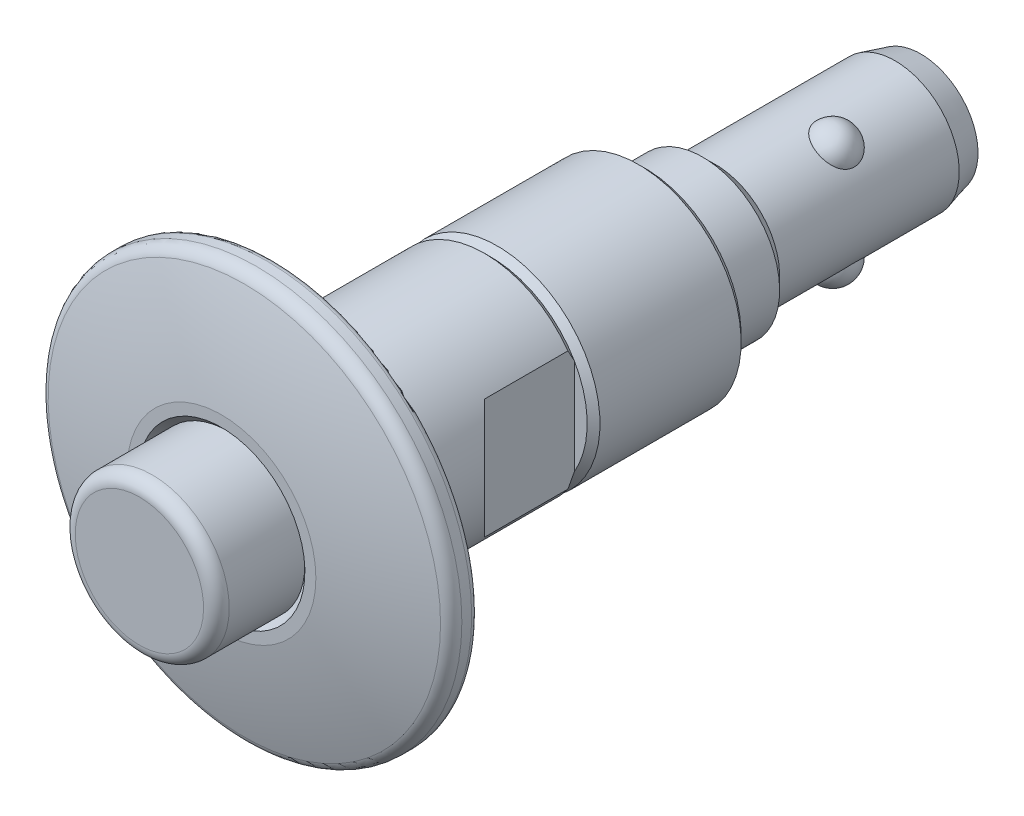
ISO-10303-21;
HEADER;
FILE_DESCRIPTION(('STEP AP214'),'2;1');
FILE_NAME('part.step','',(''),(''),'','','');
FILE_SCHEMA(('AUTOMOTIVE_DESIGN { 1 0 10303 214 1 1 1 1 }'));
ENDSEC;
DATA;
#1=APPLICATION_CONTEXT('core data for automotive mechanical design processes');
#2=APPLICATION_PROTOCOL_DEFINITION('international standard','automotive_design',2000,#1);
#3=PRODUCT_CONTEXT('',#1,'mechanical');
#4=PRODUCT('Part','Part','',(#3));
#5=PRODUCT_RELATED_PRODUCT_CATEGORY('part','',(#4));
#6=PRODUCT_DEFINITION_FORMATION('','',#4);
#7=PRODUCT_DEFINITION_CONTEXT('part definition',#1,'design');
#8=PRODUCT_DEFINITION('design','',#6,#7);
#9=PRODUCT_DEFINITION_SHAPE('','',#8);
#10=(LENGTH_UNIT() NAMED_UNIT(*) SI_UNIT(.MILLI.,.METRE.));
#11=(NAMED_UNIT(*) PLANE_ANGLE_UNIT() SI_UNIT($,.RADIAN.));
#12=(NAMED_UNIT(*) SI_UNIT($,.STERADIAN.) SOLID_ANGLE_UNIT());
#13=UNCERTAINTY_MEASURE_WITH_UNIT(LENGTH_MEASURE(1.E-05),#10,'distance_accuracy_value','');
#14=(GEOMETRIC_REPRESENTATION_CONTEXT(3) GLOBAL_UNCERTAINTY_ASSIGNED_CONTEXT((#13)) GLOBAL_UNIT_ASSIGNED_CONTEXT((#10,
#11,#12)) REPRESENTATION_CONTEXT('',''));
#15=CARTESIAN_POINT('',(0.,0.,0.));
#16=DIRECTION('',(0.,0.,1.));
#17=DIRECTION('',(1.,0.,0.));
#18=AXIS2_PLACEMENT_3D('',#15,#16,#17);
#19=CARTESIAN_POINT('',(-4.25,0.,-12.5));
#20=DIRECTION('',(0.650530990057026,0.150097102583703,0.744500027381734));
#21=DIRECTION('',(0.0570172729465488,-0.987161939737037,0.149198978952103));
#22=AXIS2_PLACEMENT_3D('',#19,#20,#21);
#23=SPHERICAL_SURFACE('',#22,1.75);
#24=CARTESIAN_POINT('',(-4.70588235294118,-1.68957724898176,-12.5));
#25=CARTESIAN_POINT('',(-4.7058816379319,-1.68957831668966,-12.5836499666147));
#26=CARTESIAN_POINT('',(-4.70837703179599,-1.68267646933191,-12.6672936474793));
#27=CARTESIAN_POINT('',(-4.71805521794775,-1.65534315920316,-12.8320541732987));
#28=CARTESIAN_POINT('',(-4.72523829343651,-1.63491087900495,-12.913170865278));
#29=CARTESIAN_POINT('',(-4.74343520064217,-1.58133262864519,-13.0704191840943));
#30=CARTESIAN_POINT('',(-4.75444114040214,-1.5482128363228,-13.146560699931));
#31=CARTESIAN_POINT('',(-4.77908644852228,-1.47037155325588,-13.2921779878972));
#32=CARTESIAN_POINT('',(-4.7927262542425,-1.42564813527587,-13.3616526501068));
#33=CARTESIAN_POINT('',(-4.82173213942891,-1.32429589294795,-13.4946333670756));
#34=CARTESIAN_POINT('',(-4.83714021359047,-1.26732417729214,-13.5578683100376));
#35=CARTESIAN_POINT('',(-4.86777124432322,-1.14404340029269,-13.6745059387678));
#36=CARTESIAN_POINT('',(-4.88299415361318,-1.07773200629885,-13.7279061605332));
#37=CARTESIAN_POINT('',(-4.91287952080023,-0.932462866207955,-13.8274539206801));
#38=CARTESIAN_POINT('',(-4.92742485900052,-0.852940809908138,-13.8728141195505));
#39=CARTESIAN_POINT('',(-4.95324708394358,-0.687293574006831,-13.9505567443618));
#40=CARTESIAN_POINT('',(-4.96452314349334,-0.601166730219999,-13.982935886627));
#41=CARTESIAN_POINT('',(-4.98313672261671,-0.42063451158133,-14.0353781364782));
#42=CARTESIAN_POINT('',(-4.99027773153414,-0.326031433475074,-14.0548323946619));
#43=CARTESIAN_POINT('',(-4.99910300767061,-0.134698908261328,-14.078771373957));
#44=CARTESIAN_POINT('',(-5.00078672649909,-0.0379692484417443,-14.0832545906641));
#45=CARTESIAN_POINT('',(-4.99851279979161,0.156336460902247,-14.0771396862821));
#46=CARTESIAN_POINT('',(-4.99447419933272,0.25390485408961,-14.0663251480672));
#47=CARTESIAN_POINT('',(-4.98102180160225,0.44572328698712,-14.0293867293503));
#48=CARTESIAN_POINT('',(-4.97160774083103,0.539973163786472,-14.0032620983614));
#49=CARTESIAN_POINT('',(-4.94839574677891,0.722378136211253,-13.9361356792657));
#50=CARTESIAN_POINT('',(-4.93460076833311,0.810537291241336,-13.8951439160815));
#51=CARTESIAN_POINT('',(-4.90411782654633,0.97820987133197,-13.7989637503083));
#52=CARTESIAN_POINT('',(-4.88742986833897,1.05772331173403,-13.7437753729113));
#53=CARTESIAN_POINT('',(-4.85339662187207,1.20420084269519,-13.6213994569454));
#54=CARTESIAN_POINT('',(-4.83606922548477,1.27137003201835,-13.5544530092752));
#55=CARTESIAN_POINT('',(-4.80255134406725,1.39264827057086,-13.4093569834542));
#56=CARTESIAN_POINT('',(-4.78636047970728,1.44676169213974,-13.3312111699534));
#57=CARTESIAN_POINT('',(-4.7580282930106,1.53730410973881,-13.1703315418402));
#58=CARTESIAN_POINT('',(-4.74571390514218,1.57453853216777,-13.0880825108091));
#59=CARTESIAN_POINT('',(-4.72557053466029,1.6340080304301,-12.9178178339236));
#60=CARTESIAN_POINT('',(-4.71773896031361,1.6562517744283,-12.8298055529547));
#61=CARTESIAN_POINT('',(-4.70799736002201,1.68373270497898,-12.6575963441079));
#62=CARTESIAN_POINT('',(-4.70569000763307,1.69011238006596,-12.57360295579));
#63=CARTESIAN_POINT('',(-4.70609981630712,1.68897215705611,-12.4057328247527));
#64=CARTESIAN_POINT('',(-4.70881580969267,1.68145548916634,-12.3218560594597));
#65=CARTESIAN_POINT('',(-4.71875745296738,1.65334034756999,-12.1597296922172));
#66=CARTESIAN_POINT('',(-4.72581832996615,1.63321939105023,-12.0813861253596));
#67=CARTESIAN_POINT('',(-4.74352838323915,1.58104146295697,-11.929223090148));
#68=CARTESIAN_POINT('',(-4.75417791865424,1.548983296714,-11.85540407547));
#69=CARTESIAN_POINT('',(-4.77834715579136,1.47276565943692,-11.7117904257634));
#70=CARTESIAN_POINT('',(-4.79194625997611,1.42825882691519,-11.6421940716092));
#71=CARTESIAN_POINT('',(-4.8204292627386,1.32895658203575,-11.5110834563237));
#72=CARTESIAN_POINT('',(-4.83531352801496,1.27415822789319,-11.449571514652));
#73=CARTESIAN_POINT('',(-4.86601376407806,1.15159229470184,-11.3317395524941));
#74=CARTESIAN_POINT('',(-4.88182228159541,1.08318658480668,-11.2760812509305));
#75=CARTESIAN_POINT('',(-4.91175690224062,0.93815128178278,-11.176204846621));
#76=CARTESIAN_POINT('',(-4.92588250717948,0.861519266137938,-11.1319901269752));
#77=CARTESIAN_POINT('',(-4.95190213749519,0.697131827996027,-11.0533437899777));
#78=CARTESIAN_POINT('',(-4.9636084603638,0.60898347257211,-11.019669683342));
#79=CARTESIAN_POINT('',(-4.98247400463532,0.428052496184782,-10.9664620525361));
#80=CARTESIAN_POINT('',(-4.98963246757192,0.335269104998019,-10.9469308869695));
#81=CARTESIAN_POINT('',(-4.99883289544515,0.144904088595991,-10.9219492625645));
#82=CARTESIAN_POINT('',(-5.00072521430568,0.0472609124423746,-10.9169104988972));
#83=CARTESIAN_POINT('',(-4.99877180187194,-0.147557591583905,-10.9221641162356));
#84=CARTESIAN_POINT('',(-4.99492569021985,-0.244732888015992,-10.9324575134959));
#85=CARTESIAN_POINT('',(-4.98184859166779,-0.43642438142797,-10.96832278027));
#86=CARTESIAN_POINT('',(-4.97258733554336,-0.530922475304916,-10.9939805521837));
#87=CARTESIAN_POINT('',(-4.94962318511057,-0.713962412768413,-11.0602463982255));
#88=CARTESIAN_POINT('',(-4.93592012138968,-0.802504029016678,-11.1008550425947));
#89=CARTESIAN_POINT('',(-4.90566981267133,-0.970377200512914,-11.1959932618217));
#90=CARTESIAN_POINT('',(-4.88914382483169,-1.0497706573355,-11.2504201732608));
#91=CARTESIAN_POINT('',(-4.85505317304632,-1.19758887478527,-11.3723232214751));
#92=CARTESIAN_POINT('',(-4.83748862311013,-1.26601483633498,-11.4397979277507));
#93=CARTESIAN_POINT('',(-4.80405950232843,-1.38738934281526,-11.5837595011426));
#94=CARTESIAN_POINT('',(-4.78815718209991,-1.44079055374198,-11.6598549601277));
#95=CARTESIAN_POINT('',(-4.75938447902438,-1.5331711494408,-11.8208661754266));
#96=CARTESIAN_POINT('',(-4.74651232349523,-1.57215897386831,-11.9057767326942));
#97=CARTESIAN_POINT('',(-4.72640357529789,-1.63156862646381,-12.0746046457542));
#98=CARTESIAN_POINT('',(-4.71879210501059,-1.653248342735,-12.1580350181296));
#99=CARTESIAN_POINT('',(-4.70853280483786,-1.6822493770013,-12.3276465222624));
#100=CARTESIAN_POINT('',(-4.70588308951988,-1.68957614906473,-12.4138265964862));
#101=CARTESIAN_POINT('',(-4.70588235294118,-1.68957724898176,-12.5));
#102=B_SPLINE_CURVE_WITH_KNOTS('',3,(#24,#25,#26,#27,#28,#29,#30,#31,#32,#33,#34,#35,#36,#37,
#38,#39,#40,#41,#42,#43,#44,#45,#46,#47,#48,#49,#50,#51,#52,#53,#54,#55,#56,#57,#58,#59,#60,#61,
#62,#63,#64,#65,#66,#67,#68,#69,#70,#71,#72,#73,#74,#75,#76,#77,#78,#79,#80,#81,#82,#83,#84,#85,
#86,#87,#88,#89,#90,#91,#92,#93,#94,#95,#96,#97,#98,#99,#100,#101),.UNSPECIFIED.,.T.,.F.,(4,2,2,
2,2,2,2,2,2,2,2,2,2,2,2,2,2,2,2,2,2,2,2,2,2,2,2,2,2,2,2,2,2,2,2,2,2,2,4),(0.,0.25062442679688,
0.501263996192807,0.751389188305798,1.00155595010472,1.25994238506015,1.51839346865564,
1.79525043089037,2.07217738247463,2.361366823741,2.65058532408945,2.94393655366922,
3.23730216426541,3.53047032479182,3.82363796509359,4.11137744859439,4.39902043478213,
4.67092933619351,4.9426808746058,5.19420759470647,5.44567585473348,5.68814976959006,
5.93064795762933,6.18073628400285,6.43089620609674,6.69851064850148,6.96620411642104,
7.25016014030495,7.53416350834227,7.82615869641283,8.11817323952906,8.41183588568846,
8.70550973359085,8.99706249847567,9.28858331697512,9.57004289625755,9.85133740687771,
10.1096204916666,10.3678054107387),.UNSPECIFIED.);
#103=CARTESIAN_POINT('',(-4.70588235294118,-1.68957724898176,-12.5));
#104=VERTEX_POINT('',#103);
#105=EDGE_CURVE('E9',#104,#104,#102,.T.);
#106=ORIENTED_EDGE('',*,*,#105,.F.);
#107=EDGE_LOOP('',(#106));
#108=FACE_BOUND('',#107,.T.);
#109=ADVANCED_FACE('F15',(#108),#23,.T.);
#110=CARTESIAN_POINT('',(6.,0.,39.4));
#111=DIRECTION('',(0.,0.,-1.));
#112=DIRECTION('',(0.,1.,0.));
#113=AXIS2_PLACEMENT_3D('',#110,#111,#112);
#114=PLANE('',#113);
#115=CARTESIAN_POINT('',(0.,0.,39.4));
#116=DIRECTION('',(0.,0.,-1.));
#117=DIRECTION('',(0.,1.,0.));
#118=AXIS2_PLACEMENT_3D('',#115,#116,#117);
#119=CIRCLE('',#118,5.);
#120=CARTESIAN_POINT('',(0.,5.,39.4));
#121=VERTEX_POINT('',#120);
#122=EDGE_CURVE('E319',#121,#121,#119,.F.);
#123=ORIENTED_EDGE('',*,*,#122,.T.);
#124=EDGE_LOOP('',(#123));
#125=FACE_BOUND('',#124,.T.);
#126=ADVANCED_FACE('F158',(#125),#114,.F.);
#127=CARTESIAN_POINT('',(0.,0.,38.4));
#128=DIRECTION('',(0.,0.,-1.));
#129=DIRECTION('',(0.,1.,0.));
#130=AXIS2_PLACEMENT_3D('',#127,#128,#129);
#131=TOROIDAL_SURFACE('',#130,5.,1.);
#132=CARTESIAN_POINT('',(0.,0.,38.4));
#133=DIRECTION('',(0.,0.,-1.));
#134=DIRECTION('',(0.,1.,0.));
#135=AXIS2_PLACEMENT_3D('',#132,#133,#134);
#136=CIRCLE('',#135,6.);
#137=CARTESIAN_POINT('',(0.,6.,38.4));
#138=VERTEX_POINT('',#137);
#139=EDGE_CURVE('E316',#138,#138,#136,.T.);
#140=ORIENTED_EDGE('',*,*,#139,.F.);
#141=EDGE_LOOP('',(#140));
#142=FACE_BOUND('',#141,.T.);
#143=ORIENTED_EDGE('',*,*,#122,.F.);
#144=EDGE_LOOP('',(#143));
#145=FACE_BOUND('',#144,.T.);
#146=ADVANCED_FACE('F173',(#142,#145),#131,.T.);
#147=CARTESIAN_POINT('',(0.,0.,92.7115005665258));
#148=DIRECTION('',(0.,0.,1.));
#149=DIRECTION('',(0.,-1.,0.));
#150=AXIS2_PLACEMENT_3D('',#147,#148,#149);
#151=CYLINDRICAL_SURFACE('',#150,6.);
#152=CARTESIAN_POINT('',(0.,0.,32.5));
#153=DIRECTION('',(0.,0.,1.));
#154=DIRECTION('',(0.,-1.,0.));
#155=AXIS2_PLACEMENT_3D('',#152,#153,#154);
#156=CIRCLE('',#155,6.);
#157=CARTESIAN_POINT('',(0.,-6.,32.5));
#158=VERTEX_POINT('',#157);
#159=EDGE_CURVE('E120',#158,#158,#156,.T.);
#160=ORIENTED_EDGE('',*,*,#159,.T.);
#161=EDGE_LOOP('',(#160));
#162=FACE_BOUND('',#161,.T.);
#163=ORIENTED_EDGE('',*,*,#139,.T.);
#164=EDGE_LOOP('',(#163));
#165=FACE_BOUND('',#164,.T.);
#166=ADVANCED_FACE('F180',(#162,#165),#151,.T.);
#167=CARTESIAN_POINT('',(0.,0.,32.5));
#168=DIRECTION('',(0.,0.,1.));
#169=DIRECTION('',(0.,-1.,0.));
#170=AXIS2_PLACEMENT_3D('',#167,#168,#169);
#171=CONICAL_SURFACE('',#170,6.,0.785398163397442);
#172=CARTESIAN_POINT('',(0.,0.,33.));
#173=DIRECTION('',(0.,0.,1.));
#174=DIRECTION('',(0.,-1.,0.));
#175=AXIS2_PLACEMENT_3D('',#172,#173,#174);
#176=CIRCLE('',#175,6.5);
#177=CARTESIAN_POINT('',(0.,-6.5,33.));
#178=VERTEX_POINT('',#177);
#179=EDGE_CURVE('E745',#178,#178,#176,.F.);
#180=ORIENTED_EDGE('',*,*,#179,.F.);
#181=EDGE_LOOP('',(#180));
#182=FACE_BOUND('',#181,.T.);
#183=ORIENTED_EDGE('',*,*,#159,.F.);
#184=EDGE_LOOP('',(#183));
#185=FACE_BOUND('',#184,.T.);
#186=ADVANCED_FACE('F368',(#182,#185),#171,.F.);
#187=CARTESIAN_POINT('',(2.5,0.,33.));
#188=DIRECTION('',(0.,0.,1.));
#189=DIRECTION('',(0.,-1.,0.));
#190=AXIS2_PLACEMENT_3D('',#187,#188,#189);
#191=PLANE('',#190);
#192=ORIENTED_EDGE('',*,*,#179,.T.);
#193=EDGE_LOOP('',(#192));
#194=FACE_BOUND('',#193,.T.);
#195=CARTESIAN_POINT('',(0.,0.,33.));
#196=DIRECTION('',(0.,0.,-1.));
#197=DIRECTION('',(0.,1.,0.));
#198=AXIS2_PLACEMENT_3D('',#195,#196,#197);
#199=CIRCLE('',#198,7.35465362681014);
#200=CARTESIAN_POINT('',(7.35465362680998,0.,33.));
#201=VERTEX_POINT('',#200);
#202=EDGE_CURVE('E294',#201,#201,#199,.T.);
#203=ORIENTED_EDGE('',*,*,#202,.F.);
#204=EDGE_LOOP('',(#203));
#205=FACE_BOUND('',#204,.T.);
#206=ADVANCED_FACE('F364',(#194,#205),#191,.T.);
#207=CARTESIAN_POINT('',(0.,0.,-18.4772675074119));
#208=DIRECTION('',(0.,0.,-1.));
#209=DIRECTION('',(1.,0.,0.));
#210=AXIS2_PLACEMENT_3D('',#207,#208,#209);
#211=SPHERICAL_SURFACE('',#210,52.);
#212=CARTESIAN_POINT('',(0.,0.,31.2227321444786));
#213=DIRECTION('',(0.,0.,-1.));
#214=DIRECTION('',(0.,1.,0.));
#215=AXIS2_PLACEMENT_3D('',#212,#213,#214);
#216=CIRCLE('',#215,15.2941176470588);
#217=CARTESIAN_POINT('',(15.2941176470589,0.,31.2227321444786));
#218=VERTEX_POINT('',#217);
#219=EDGE_CURVE('E742',#218,#218,#216,.F.);
#220=CARTESIAN_POINT('',(15.2941176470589,0.,31.2227321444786));
#221=CARTESIAN_POINT('',(15.2130338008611,0.,31.2476839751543));
#222=CARTESIAN_POINT('',(15.1318888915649,0.,31.2724373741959));
#223=CARTESIAN_POINT('',(14.9694788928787,0.,31.32154672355));
#224=CARTESIAN_POINT('',(14.8882138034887,0.,31.3459026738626));
#225=CARTESIAN_POINT('',(14.7255653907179,0.,31.3942165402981));
#226=CARTESIAN_POINT('',(14.6441820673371,0.,31.418174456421));
#227=CARTESIAN_POINT('',(14.4812991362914,0.,31.4656916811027));
#228=CARTESIAN_POINT('',(14.3997995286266,0.,31.4892509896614));
#229=CARTESIAN_POINT('',(14.2366859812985,0.,31.5359704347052));
#230=CARTESIAN_POINT('',(14.1550720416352,0.,31.5591305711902));
#231=CARTESIAN_POINT('',(13.9917317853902,0.,31.6050511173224));
#232=CARTESIAN_POINT('',(13.9100054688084,0.,31.6278115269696));
#233=CARTESIAN_POINT('',(13.7464424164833,0.,31.6729320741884));
#234=CARTESIAN_POINT('',(13.66460568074,0.,31.69529221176));
#235=CARTESIAN_POINT('',(13.5008237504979,0.,31.7396116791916));
#236=CARTESIAN_POINT('',(13.4188785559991,0.,31.7615710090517));
#237=CARTESIAN_POINT('',(13.2548816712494,0.,31.805088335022));
#238=CARTESIAN_POINT('',(13.1728299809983,0.,31.8266463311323));
#239=CARTESIAN_POINT('',(13.0086220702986,0.,31.8693604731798));
#240=CARTESIAN_POINT('',(12.9264658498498,0.,31.8905166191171));
#241=CARTESIAN_POINT('',(12.7620508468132,0.,31.9324265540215));
#242=CARTESIAN_POINT('',(12.6797920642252,0.,31.9531803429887));
#243=CARTESIAN_POINT('',(12.5151739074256,0.,31.9942850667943));
#244=CARTESIAN_POINT('',(12.4328145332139,0.,32.0146360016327));
#245=CARTESIAN_POINT('',(12.2679971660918,0.,32.0549345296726));
#246=CARTESIAN_POINT('',(12.1855391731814,0.,32.0748821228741));
#247=CARTESIAN_POINT('',(12.0205265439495,0.,32.114373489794));
#248=CARTESIAN_POINT('',(11.9379719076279,0.,32.1339172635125));
#249=CARTESIAN_POINT('',(11.7727679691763,0.,32.1726005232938));
#250=CARTESIAN_POINT('',(11.6901186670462,0.,32.1917400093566));
#251=CARTESIAN_POINT('',(11.5247273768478,0.,32.2296142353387));
#252=CARTESIAN_POINT('',(11.4419853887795,0.,32.2483489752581));
#253=CARTESIAN_POINT('',(11.2764107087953,0.,32.2854132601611));
#254=CARTESIAN_POINT('',(11.1935780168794,0.,32.3037428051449));
#255=CARTESIAN_POINT('',(11.0278239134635,0.,32.3399962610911));
#256=CARTESIAN_POINT('',(10.9449025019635,0.,32.3579201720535));
#257=CARTESIAN_POINT('',(10.7789729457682,0.,32.3933619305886));
#258=CARTESIAN_POINT('',(10.6959648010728,0.,32.4108797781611));
#259=CARTESIAN_POINT('',(10.5298637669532,0.,32.445508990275));
#260=CARTESIAN_POINT('',(10.4467708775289,0.,32.4626203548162));
#261=CARTESIAN_POINT('',(10.2805023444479,0.,32.4964361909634));
#262=CARTESIAN_POINT('',(10.1973267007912,0.,32.5131406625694));
#263=CARTESIAN_POINT('',(10.0308946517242,0.,32.546142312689));
#264=CARTESIAN_POINT('',(9.94763824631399,0.,32.5624394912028));
#265=CARTESIAN_POINT('',(9.78104666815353,0.,32.5946261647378));
#266=CARTESIAN_POINT('',(9.69771149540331,0.,32.6105156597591));
#267=CARTESIAN_POINT('',(9.53096437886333,0.,32.6418865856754));
#268=CARTESIAN_POINT('',(9.44755243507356,0.,32.6573680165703));
#269=CARTESIAN_POINT('',(9.28065377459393,0.,32.6879224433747));
#270=CARTESIAN_POINT('',(9.19716705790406,0.,32.7029954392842));
#271=CARTESIAN_POINT('',(9.03012085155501,0.,32.7327326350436));
#272=CARTESIAN_POINT('',(8.94656136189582,0.,32.7473968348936));
#273=CARTESIAN_POINT('',(8.77937161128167,0.,32.7763160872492));
#274=CARTESIAN_POINT('',(8.6957413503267,0.,32.7905711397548));
#275=CARTESIAN_POINT('',(8.52841206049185,0.,32.8186717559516));
#276=CARTESIAN_POINT('',(8.44471303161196,0.,32.8325173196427));
#277=CARTESIAN_POINT('',(8.27724821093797,0.,32.8597986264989));
#278=CARTESIAN_POINT('',(8.19348241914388,0.,32.8732343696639));
#279=CARTESIAN_POINT('',(8.02588607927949,0.,32.899695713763));
#280=CARTESIAN_POINT('',(7.9420555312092,0.,32.9127213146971));
#281=CARTESIAN_POINT('',(7.77433168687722,0.,32.9383620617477));
#282=CARTESIAN_POINT('',(7.69043839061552,0.,32.9509772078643));
#283=CARTESIAN_POINT('',(7.52259105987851,0.,32.9757967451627));
#284=CARTESIAN_POINT('',(7.4386370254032,0.,32.9880011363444));
#285=CARTESIAN_POINT('',(7.35465362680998,0.,33.));
#286=B_SPLINE_CURVE_WITH_KNOTS('',3,(#220,#221,#222,#223,#224,#225,#226,#227,#228,#229,#230,
#231,#232,#233,#234,#235,#236,#237,#238,#239,#240,#241,#242,#243,#244,#245,#246,#247,#248,#249,
#250,#251,#252,#253,#254,#255,#256,#257,#258,#259,#260,#261,#262,#263,#264,#265,#266,#267,#268,
#269,#270,#271,#272,#273,#274,#275,#276,#277,#278,#279,#280,#281,#282,#283,#284,#285),
.UNSPECIFIED.,.F.,.F.,(4,2,2,2,2,2,2,2,2,2,2,2,2,2,2,2,2,2,2,2,2,2,2,2,2,2,2,2,2,2,2,2,4),(0.,
0.254508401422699,0.509016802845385,0.76352520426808,1.01803360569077,1.27254200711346,
1.52705040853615,1.78155880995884,2.03606721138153,2.29057561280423,2.54508401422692,
2.79959241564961,3.05410081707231,3.30860921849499,3.56311761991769,3.81762602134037,
4.07213442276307,4.32664282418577,4.58115122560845,4.83565962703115,5.09016802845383,
5.34467642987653,5.59918483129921,5.85369323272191,6.10820163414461,6.36271003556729,
6.61721843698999,6.87172683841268,7.12623523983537,7.38074364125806,7.63525204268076,
7.88976044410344,8.14426884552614),.UNSPECIFIED.);
#287=EDGE_CURVE('BSEAM367',#218,#201,#286,.T.);
#288=ORIENTED_EDGE('',*,*,#219,.T.);
#289=ORIENTED_EDGE('',*,*,#202,.T.);
#290=ORIENTED_EDGE('',*,*,#287,.T.);
#291=ORIENTED_EDGE('',*,*,#287,.F.);
#292=EDGE_LOOP('',(#288,#290,#289,#291));
#293=FACE_BOUND('',#292,.T.);
#294=ADVANCED_FACE('F367',(#293),#211,.T.);
#295=CARTESIAN_POINT('',(0.,0.,30.2669629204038));
#296=DIRECTION('',(0.,0.,-1.));
#297=DIRECTION('',(0.,1.,0.));
#298=AXIS2_PLACEMENT_3D('',#295,#296,#297);
#299=TOROIDAL_SURFACE('',#298,15.,1.);
#300=ORIENTED_EDGE('',*,*,#219,.F.);
#301=EDGE_LOOP('',(#300));
#302=FACE_BOUND('',#301,.T.);
#303=CARTESIAN_POINT('',(0.,0.,30.2669629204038));
#304=DIRECTION('',(0.,0.,-1.));
#305=DIRECTION('',(0.,1.,0.));
#306=AXIS2_PLACEMENT_3D('',#303,#304,#305);
#307=CIRCLE('',#306,16.);
#308=CARTESIAN_POINT('',(0.,16.,30.2669629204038));
#309=VERTEX_POINT('',#308);
#310=EDGE_CURVE('E229',#309,#309,#307,.T.);
#311=ORIENTED_EDGE('',*,*,#310,.F.);
#312=EDGE_LOOP('',(#311));
#313=FACE_BOUND('',#312,.T.);
#314=ADVANCED_FACE('F371',(#302,#313),#299,.T.);
#315=CARTESIAN_POINT('',(0.,0.,-5.5));
#316=DIRECTION('',(0.,0.,-1.));
#317=DIRECTION('',(0.,1.,0.));
#318=AXIS2_PLACEMENT_3D('',#315,#316,#317);
#319=CYLINDRICAL_SURFACE('',#318,16.);
#320=CARTESIAN_POINT('',(0.,0.,29.5));
#321=DIRECTION('',(0.,0.,-1.));
#322=DIRECTION('',(0.,1.,0.));
#323=AXIS2_PLACEMENT_3D('',#320,#321,#322);
#324=CIRCLE('',#323,16.);
#325=CARTESIAN_POINT('',(0.,16.,29.5));
#326=VERTEX_POINT('',#325);
#327=EDGE_CURVE('E741',#326,#326,#324,.F.);
#328=ORIENTED_EDGE('',*,*,#327,.T.);
#329=EDGE_LOOP('',(#328));
#330=FACE_BOUND('',#329,.T.);
#331=ORIENTED_EDGE('',*,*,#310,.T.);
#332=EDGE_LOOP('',(#331));
#333=FACE_BOUND('',#332,.T.);
#334=ADVANCED_FACE('F609',(#330,#333),#319,.T.);
#335=CARTESIAN_POINT('',(0.,0.,29.5));
#336=DIRECTION('',(0.,0.,-1.));
#337=DIRECTION('',(0.,1.,0.));
#338=AXIS2_PLACEMENT_3D('',#335,#336,#337);
#339=TOROIDAL_SURFACE('',#338,15.5,0.5);
#340=ORIENTED_EDGE('',*,*,#327,.F.);
#341=EDGE_LOOP('',(#340));
#342=FACE_BOUND('',#341,.T.);
#343=CARTESIAN_POINT('',(0.,0.,29.));
#344=DIRECTION('',(0.,0.,-1.));
#345=DIRECTION('',(0.,1.,0.));
#346=AXIS2_PLACEMENT_3D('',#343,#344,#345);
#347=CIRCLE('',#346,15.5);
#348=CARTESIAN_POINT('',(0.,15.5,29.));
#349=VERTEX_POINT('',#348);
#350=EDGE_CURVE('E739',#349,#349,#347,.T.);
#351=ORIENTED_EDGE('',*,*,#350,.F.);
#352=EDGE_LOOP('',(#351));
#353=FACE_BOUND('',#352,.T.);
#354=ADVANCED_FACE('F618',(#342,#353),#339,.T.);
#355=CARTESIAN_POINT('',(16.,0.,29.));
#356=DIRECTION('',(0.,0.,-1.));
#357=DIRECTION('',(0.,1.,0.));
#358=AXIS2_PLACEMENT_3D('',#355,#356,#357);
#359=PLANE('',#358);
#360=ORIENTED_EDGE('',*,*,#350,.T.);
#361=EDGE_LOOP('',(#360));
#362=FACE_BOUND('',#361,.T.);
#363=CARTESIAN_POINT('',(0.,0.,29.));
#364=DIRECTION('',(0.,0.,-1.));
#365=DIRECTION('',(0.,1.,0.));
#366=AXIS2_PLACEMENT_3D('',#363,#364,#365);
#367=CIRCLE('',#366,11.);
#368=CARTESIAN_POINT('',(0.,11.,29.));
#369=VERTEX_POINT('',#368);
#370=EDGE_CURVE('E300',#369,#369,#367,.T.);
#371=ORIENTED_EDGE('',*,*,#370,.F.);
#372=EDGE_LOOP('',(#371));
#373=FACE_BOUND('',#372,.T.);
#374=ADVANCED_FACE('F628',(#362,#373),#359,.T.);
#375=CARTESIAN_POINT('',(0.,0.,26.));
#376=DIRECTION('',(0.,0.,-1.));
#377=DIRECTION('',(0.,1.,0.));
#378=AXIS2_PLACEMENT_3D('',#375,#376,#377);
#379=TOROIDAL_SURFACE('',#378,11.,3.);
#380=ORIENTED_EDGE('',*,*,#370,.T.);
#381=EDGE_LOOP('',(#380));
#382=FACE_BOUND('',#381,.T.);
#383=CARTESIAN_POINT('',(0.,0.,26.));
#384=DIRECTION('',(0.,0.,-1.));
#385=DIRECTION('',(0.,1.,0.));
#386=AXIS2_PLACEMENT_3D('',#383,#384,#385);
#387=CIRCLE('',#386,8.);
#388=CARTESIAN_POINT('',(0.,8.,26.));
#389=VERTEX_POINT('',#388);
#390=EDGE_CURVE('E297',#389,#389,#387,.T.);
#391=ORIENTED_EDGE('',*,*,#390,.F.);
#392=EDGE_LOOP('',(#391));
#393=FACE_BOUND('',#392,.T.);
#394=ADVANCED_FACE('F638',(#382,#393),#379,.F.);
#395=CARTESIAN_POINT('',(6.5,14.,19.));
#396=DIRECTION('',(-0.707106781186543,0.,0.707106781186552));
#397=DIRECTION('',(-0.707106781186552,0.,-0.707106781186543));
#398=AXIS2_PLACEMENT_3D('',#395,#396,#397);
#399=PLANE('',#398);
#400=DIRECTION('',(0.,-1.,0.));
#401=VECTOR('',#400,1.);
#402=CARTESIAN_POINT('',(6.5,14.,19.));
#403=LINE('',#402,#401);
#404=CARTESIAN_POINT('',(6.5,4.66368952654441,19.));
#405=VERTEX_POINT('',#404);
#406=CARTESIAN_POINT('',(6.5,-4.66368952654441,19.));
#407=VERTEX_POINT('',#406);
#408=EDGE_CURVE('E263',#405,#407,#403,.T.);
#409=ORIENTED_EDGE('',*,*,#408,.F.);
#410=CARTESIAN_POINT('',(0.,0.,12.5));
#411=DIRECTION('',(-0.707106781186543,0.,0.707106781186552));
#412=DIRECTION('',(-0.707106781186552,0.,-0.707106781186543));
#413=AXIS2_PLACEMENT_3D('',#410,#411,#412);
#414=ELLIPSE('',#413,11.3137084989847,8.);
#415=EDGE_CURVE('E265',#405,#407,#414,.F.);
#416=ORIENTED_EDGE('',*,*,#415,.T.);
#417=EDGE_LOOP('',(#409,#416));
#418=FACE_BOUND('',#417,.T.);
#419=ADVANCED_FACE('F207',(#418),#399,.F.);
#420=CARTESIAN_POINT('',(-6.5,14.,19.));
#421=DIRECTION('',(0.707106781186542,0.,0.707106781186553));
#422=DIRECTION('',(-0.707106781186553,0.,0.707106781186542));
#423=AXIS2_PLACEMENT_3D('',#420,#421,#422);
#424=PLANE('',#423);
#425=DIRECTION('',(0.,-1.,0.));
#426=VECTOR('',#425,1.);
#427=CARTESIAN_POINT('',(-6.5,14.,19.));
#428=LINE('',#427,#426);
#429=CARTESIAN_POINT('',(-6.5,4.66368952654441,19.));
#430=VERTEX_POINT('',#429);
#431=CARTESIAN_POINT('',(-6.5,-4.66368952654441,19.));
#432=VERTEX_POINT('',#431);
#433=EDGE_CURVE('E304',#430,#432,#428,.T.);
#434=ORIENTED_EDGE('',*,*,#433,.T.);
#435=CARTESIAN_POINT('',(0.,0.,12.5));
#436=DIRECTION('',(0.707106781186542,0.,0.707106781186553));
#437=DIRECTION('',(0.707106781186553,0.,-0.707106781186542));
#438=AXIS2_PLACEMENT_3D('',#435,#436,#437);
#439=ELLIPSE('',#438,11.3137084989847,8.);
#440=EDGE_CURVE('E268',#432,#430,#439,.F.);
#441=ORIENTED_EDGE('',*,*,#440,.T.);
#442=EDGE_LOOP('',(#434,#441));
#443=FACE_BOUND('',#442,.T.);
#444=ADVANCED_FACE('F203',(#443),#424,.F.);
#445=CARTESIAN_POINT('',(6.5,14.,19.));
#446=DIRECTION('',(-1.,0.,0.));
#447=DIRECTION('',(0.,-1.,0.));
#448=AXIS2_PLACEMENT_3D('',#445,#446,#447);
#449=PLANE('',#448);
#450=DIRECTION('',(0.,-1.,0.));
#451=VECTOR('',#450,1.);
#452=CARTESIAN_POINT('',(6.5,14.,12.));
#453=LINE('',#452,#451);
#454=CARTESIAN_POINT('',(6.5,3.74165738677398,12.));
#455=VERTEX_POINT('',#454);
#456=CARTESIAN_POINT('',(6.5,-3.741657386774,12.));
#457=VERTEX_POINT('',#456);
#458=EDGE_CURVE('E34',#455,#457,#453,.T.);
#459=ORIENTED_EDGE('',*,*,#458,.F.);
#460=CARTESIAN_POINT('',(6.5,3.74165738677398,12.));
#461=CARTESIAN_POINT('',(6.5,3.8198965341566,12.0390341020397));
#462=CARTESIAN_POINT('',(6.5,3.89776768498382,12.0788010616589));
#463=CARTESIAN_POINT('',(6.5,4.05278335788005,12.1596785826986));
#464=CARTESIAN_POINT('',(6.5,4.12992806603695,12.2007887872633));
#465=CARTESIAN_POINT('',(6.5,4.28353936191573,12.2842502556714));
#466=CARTESIAN_POINT('',(6.5,4.36000596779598,12.3266014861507));
#467=CARTESIAN_POINT('',(6.5,4.51231410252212,12.4124602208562));
#468=CARTESIAN_POINT('',(6.5,4.58815546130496,12.4559680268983));
#469=CARTESIAN_POINT('',(6.5,4.66368952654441,12.5));
#470=B_SPLINE_CURVE_WITH_KNOTS('',3,(#460,#461,#462,#463,#464,#465,#466,#467,#468,#469),
.UNSPECIFIED.,.F.,.F.,(4,2,2,2,4),(0.,0.262300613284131,0.52453209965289,0.786756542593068,
1.0490500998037),.UNSPECIFIED.);
#471=CARTESIAN_POINT('',(6.5,4.66368952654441,12.5));
#472=VERTEX_POINT('',#471);
#473=EDGE_CURVE('E242',#455,#472,#470,.T.);
#474=ORIENTED_EDGE('',*,*,#473,.T.);
#475=DIRECTION('',(0.,0.,-1.));
#476=VECTOR('',#475,1.);
#477=CARTESIAN_POINT('',(6.5,4.66368952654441,-5.5));
#478=LINE('',#477,#476);
#479=EDGE_CURVE('E274',#472,#405,#478,.F.);
#480=ORIENTED_EDGE('',*,*,#479,.T.);
#481=ORIENTED_EDGE('',*,*,#408,.T.);
#482=DIRECTION('',(0.,0.,-1.));
#483=VECTOR('',#482,1.);
#484=CARTESIAN_POINT('',(6.5,-4.66368952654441,-5.5));
#485=LINE('',#484,#483);
#486=CARTESIAN_POINT('',(6.5,-4.66368952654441,12.5));
#487=VERTEX_POINT('',#486);
#488=EDGE_CURVE('E259',#407,#487,#485,.T.);
#489=ORIENTED_EDGE('',*,*,#488,.T.);
#490=CARTESIAN_POINT('',(6.5,-4.66368952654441,12.5));
#491=CARTESIAN_POINT('',(6.5,-4.58815546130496,12.4559680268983));
#492=CARTESIAN_POINT('',(6.5,-4.51231410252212,12.4124602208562));
#493=CARTESIAN_POINT('',(6.5,-4.36000596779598,12.3266014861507));
#494=CARTESIAN_POINT('',(6.5,-4.28353936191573,12.2842502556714));
#495=CARTESIAN_POINT('',(6.5,-4.12992806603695,12.2007887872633));
#496=CARTESIAN_POINT('',(6.5,-4.05278335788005,12.1596785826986));
#497=CARTESIAN_POINT('',(6.5,-3.89776768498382,12.0788010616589));
#498=CARTESIAN_POINT('',(6.5,-3.8198965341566,12.0390341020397));
#499=CARTESIAN_POINT('',(6.5,-3.74165738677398,12.));
#500=B_SPLINE_CURVE_WITH_KNOTS('',3,(#490,#491,#492,#493,#494,#495,#496,#497,#498,#499),
.UNSPECIFIED.,.F.,.F.,(4,2,2,2,4),(0.,0.262293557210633,0.524518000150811,0.786749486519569,
1.0490500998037),.UNSPECIFIED.);
#501=EDGE_CURVE('E249',#487,#457,#500,.T.);
#502=ORIENTED_EDGE('',*,*,#501,.T.);
#503=EDGE_LOOP('',(#459,#474,#480,#481,#489,#502));
#504=FACE_BOUND('',#503,.T.);
#505=ADVANCED_FACE('F206',(#504),#449,.F.);
#506=CARTESIAN_POINT('',(0.,0.,-5.5));
#507=DIRECTION('',(0.,0.,-1.));
#508=DIRECTION('',(0.,1.,0.));
#509=AXIS2_PLACEMENT_3D('',#506,#507,#508);
#510=CYLINDRICAL_SURFACE('',#509,8.);
#511=ORIENTED_EDGE('',*,*,#479,.F.);
#512=CARTESIAN_POINT('',(0.,0.,12.5));
#513=DIRECTION('',(0.,0.,-1.));
#514=DIRECTION('',(0.,1.,0.));
#515=AXIS2_PLACEMENT_3D('',#512,#513,#514);
#516=CIRCLE('',#515,8.);
#517=CARTESIAN_POINT('',(-6.5,4.66368952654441,12.5));
#518=VERTEX_POINT('',#517);
#519=EDGE_CURVE('E69',#472,#518,#516,.F.);
#520=ORIENTED_EDGE('',*,*,#519,.T.);
#521=DIRECTION('',(0.,0.,-1.));
#522=VECTOR('',#521,1.);
#523=CARTESIAN_POINT('',(-6.5,4.66368952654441,-5.5));
#524=LINE('',#523,#522);
#525=EDGE_CURVE('E270',#430,#518,#524,.T.);
#526=ORIENTED_EDGE('',*,*,#525,.F.);
#527=ORIENTED_EDGE('',*,*,#440,.F.);
#528=DIRECTION('',(0.,0.,-1.));
#529=VECTOR('',#528,1.);
#530=CARTESIAN_POINT('',(-6.5,-4.66368952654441,-5.5));
#531=LINE('',#530,#529);
#532=CARTESIAN_POINT('',(-6.5,-4.66368952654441,12.5));
#533=VERTEX_POINT('',#532);
#534=EDGE_CURVE('E261',#533,#432,#531,.F.);
#535=ORIENTED_EDGE('',*,*,#534,.F.);
#536=CARTESIAN_POINT('',(0.,0.,12.5));
#537=DIRECTION('',(0.,0.,-1.));
#538=DIRECTION('',(0.,1.,0.));
#539=AXIS2_PLACEMENT_3D('',#536,#537,#538);
#540=CIRCLE('',#539,8.);
#541=EDGE_CURVE('E98',#533,#487,#540,.F.);
#542=ORIENTED_EDGE('',*,*,#541,.T.);
#543=ORIENTED_EDGE('',*,*,#488,.F.);
#544=ORIENTED_EDGE('',*,*,#415,.F.);
#545=EDGE_LOOP('',(#511,#520,#526,#527,#535,#542,#543,#544));
#546=FACE_BOUND('',#545,.T.);
#547=ORIENTED_EDGE('',*,*,#390,.T.);
#548=EDGE_LOOP('',(#547));
#549=FACE_BOUND('',#548,.T.);
#550=ADVANCED_FACE('F212',(#546,#549),#510,.T.);
#551=CARTESIAN_POINT('',(-6.5,14.,19.));
#552=DIRECTION('',(1.,0.,0.));
#553=DIRECTION('',(0.,1.,0.));
#554=AXIS2_PLACEMENT_3D('',#551,#552,#553);
#555=PLANE('',#554);
#556=ORIENTED_EDGE('',*,*,#525,.T.);
#557=CARTESIAN_POINT('',(-6.5,4.66368952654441,12.5));
#558=CARTESIAN_POINT('',(-6.5,4.58815546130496,12.4559680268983));
#559=CARTESIAN_POINT('',(-6.5,4.51231410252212,12.4124602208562));
#560=CARTESIAN_POINT('',(-6.5,4.36000596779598,12.3266014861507));
#561=CARTESIAN_POINT('',(-6.5,4.28353936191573,12.2842502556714));
#562=CARTESIAN_POINT('',(-6.5,4.12992806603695,12.2007887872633));
#563=CARTESIAN_POINT('',(-6.5,4.05278335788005,12.1596785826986));
#564=CARTESIAN_POINT('',(-6.5,3.89776768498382,12.0788010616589));
#565=CARTESIAN_POINT('',(-6.5,3.8198965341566,12.0390341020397));
#566=CARTESIAN_POINT('',(-6.5,3.74165738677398,12.));
#567=B_SPLINE_CURVE_WITH_KNOTS('',3,(#557,#558,#559,#560,#561,#562,#563,#564,#565,#566),
.UNSPECIFIED.,.F.,.F.,(4,2,2,2,4),(0.,0.262293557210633,0.524518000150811,0.786749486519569,
1.0490500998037),.UNSPECIFIED.);
#568=CARTESIAN_POINT('',(-6.5,3.741657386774,12.));
#569=VERTEX_POINT('',#568);
#570=EDGE_CURVE('E93',#518,#569,#567,.T.);
#571=ORIENTED_EDGE('',*,*,#570,.T.);
#572=DIRECTION('',(0.,-1.,0.));
#573=VECTOR('',#572,1.);
#574=CARTESIAN_POINT('',(-6.5,14.,12.));
#575=LINE('',#574,#573);
#576=CARTESIAN_POINT('',(-6.5,-3.741657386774,12.));
#577=VERTEX_POINT('',#576);
#578=EDGE_CURVE('E75',#569,#577,#575,.T.);
#579=ORIENTED_EDGE('',*,*,#578,.T.);
#580=CARTESIAN_POINT('',(-6.5,-3.74165738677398,12.));
#581=CARTESIAN_POINT('',(-6.5,-3.8198965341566,12.0390341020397));
#582=CARTESIAN_POINT('',(-6.5,-3.89776768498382,12.0788010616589));
#583=CARTESIAN_POINT('',(-6.5,-4.05278335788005,12.1596785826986));
#584=CARTESIAN_POINT('',(-6.5,-4.12992806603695,12.2007887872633));
#585=CARTESIAN_POINT('',(-6.5,-4.28353936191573,12.2842502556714));
#586=CARTESIAN_POINT('',(-6.5,-4.36000596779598,12.3266014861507));
#587=CARTESIAN_POINT('',(-6.5,-4.51231410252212,12.4124602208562));
#588=CARTESIAN_POINT('',(-6.5,-4.58815546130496,12.4559680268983));
#589=CARTESIAN_POINT('',(-6.5,-4.66368952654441,12.5));
#590=B_SPLINE_CURVE_WITH_KNOTS('',3,(#580,#581,#582,#583,#584,#585,#586,#587,#588,#589),
.UNSPECIFIED.,.F.,.F.,(4,2,2,2,4),(0.,0.262300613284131,0.52453209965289,0.786756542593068,
1.0490500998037),.UNSPECIFIED.);
#591=EDGE_CURVE('E61',#577,#533,#590,.T.);
#592=ORIENTED_EDGE('',*,*,#591,.T.);
#593=ORIENTED_EDGE('',*,*,#534,.T.);
#594=ORIENTED_EDGE('',*,*,#433,.F.);
#595=EDGE_LOOP('',(#556,#571,#579,#592,#593,#594));
#596=FACE_BOUND('',#595,.T.);
#597=ADVANCED_FACE('F91',(#596),#555,.F.);
#598=CARTESIAN_POINT('',(0.,0.,12.));
#599=DIRECTION('',(0.,0.,1.));
#600=DIRECTION('',(0.,-1.,0.));
#601=AXIS2_PLACEMENT_3D('',#598,#599,#600);
#602=CONICAL_SURFACE('',#601,7.5,0.785398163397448);
#603=ORIENTED_EDGE('',*,*,#501,.F.);
#604=ORIENTED_EDGE('',*,*,#541,.F.);
#605=ORIENTED_EDGE('',*,*,#591,.F.);
#606=CARTESIAN_POINT('',(0.,0.,12.));
#607=DIRECTION('',(0.,0.,1.));
#608=DIRECTION('',(0.16499025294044,0.986295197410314,0.));
#609=AXIS2_PLACEMENT_3D('',#606,#607,#608);
#610=CIRCLE('',#609,7.5);
#611=EDGE_CURVE('E82',#577,#457,#610,.T.);
#612=ORIENTED_EDGE('',*,*,#611,.T.);
#613=EDGE_LOOP('',(#603,#604,#605,#612));
#614=FACE_BOUND('',#613,.T.);
#615=ADVANCED_FACE('F97',(#614),#602,.T.);
#616=CARTESIAN_POINT('',(0.,0.,12.));
#617=DIRECTION('',(0.,0.,1.));
#618=DIRECTION('',(0.16499025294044,0.986295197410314,0.));
#619=AXIS2_PLACEMENT_3D('',#616,#617,#618);
#620=PLANE('',#619);
#621=EDGE_CURVE('E86',#457,#455,#610,.T.);
#622=ORIENTED_EDGE('',*,*,#621,.T.);
#623=ORIENTED_EDGE('',*,*,#458,.T.);
#624=EDGE_LOOP('',(#622,#623));
#625=FACE_BOUND('',#624,.T.);
#626=ADVANCED_FACE('F235',(#625),#620,.T.);
#627=CARTESIAN_POINT('',(0.,0.,12.));
#628=DIRECTION('',(0.,0.,1.));
#629=DIRECTION('',(0.,-1.,0.));
#630=AXIS2_PLACEMENT_3D('',#627,#628,#629);
#631=CONICAL_SURFACE('',#630,7.5,0.785398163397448);
#632=ORIENTED_EDGE('',*,*,#570,.F.);
#633=ORIENTED_EDGE('',*,*,#519,.F.);
#634=ORIENTED_EDGE('',*,*,#473,.F.);
#635=EDGE_CURVE('E102',#455,#569,#610,.T.);
#636=ORIENTED_EDGE('',*,*,#635,.T.);
#637=EDGE_LOOP('',(#632,#633,#634,#636));
#638=FACE_BOUND('',#637,.T.);
#639=ADVANCED_FACE('F231',(#638),#631,.T.);
#640=ORIENTED_EDGE('',*,*,#578,.F.);
#641=EDGE_CURVE('E84',#569,#577,#610,.T.);
#642=ORIENTED_EDGE('',*,*,#641,.T.);
#643=EDGE_LOOP('',(#640,#642));
#644=FACE_BOUND('',#643,.T.);
#645=ADVANCED_FACE('F100',(#644),#620,.T.);
#646=CARTESIAN_POINT('',(0.,0.,12.));
#647=DIRECTION('',(0.,0.,-1.));
#648=DIRECTION('',(-0.16499025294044,-0.986295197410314,0.));
#649=AXIS2_PLACEMENT_3D('',#646,#647,#648);
#650=CONICAL_SURFACE('',#649,7.5,0.785398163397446);
#651=CARTESIAN_POINT('',(0.,0.,11.5));
#652=DIRECTION('',(0.,0.,1.));
#653=DIRECTION('',(0.16499025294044,0.986295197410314,0.));
#654=AXIS2_PLACEMENT_3D('',#651,#652,#653);
#655=CIRCLE('',#654,8.);
#656=CARTESIAN_POINT('',(1.31992202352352,7.89036157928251,11.5));
#657=VERTEX_POINT('',#656);
#658=EDGE_CURVE('E115',#657,#657,#655,.F.);
#659=ORIENTED_EDGE('',*,*,#658,.F.);
#660=EDGE_LOOP('',(#659));
#661=FACE_BOUND('',#660,.T.);
#662=ORIENTED_EDGE('',*,*,#641,.F.);
#663=ORIENTED_EDGE('',*,*,#635,.F.);
#664=ORIENTED_EDGE('',*,*,#621,.F.);
#665=ORIENTED_EDGE('',*,*,#611,.F.);
#666=EDGE_LOOP('',(#662,#663,#664,#665));
#667=FACE_BOUND('',#666,.T.);
#668=ADVANCED_FACE('F83',(#661,#667),#650,.T.);
#669=CARTESIAN_POINT('',(0.,0.,12.));
#670=DIRECTION('',(0.,0.,-1.));
#671=DIRECTION('',(-0.16499025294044,-0.986295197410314,0.));
#672=AXIS2_PLACEMENT_3D('',#669,#670,#671);
#673=CYLINDRICAL_SURFACE('',#672,8.);
#674=CARTESIAN_POINT('',(0.,0.,0.5));
#675=DIRECTION('',(0.,0.,1.));
#676=DIRECTION('',(0.16499025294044,0.986295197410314,0.));
#677=AXIS2_PLACEMENT_3D('',#674,#675,#676);
#678=CIRCLE('',#677,8.);
#679=CARTESIAN_POINT('',(1.31992202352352,7.89036157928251,0.5));
#680=VERTEX_POINT('',#679);
#681=EDGE_CURVE('E111',#680,#680,#678,.T.);
#682=ORIENTED_EDGE('',*,*,#681,.T.);
#683=EDGE_LOOP('',(#682));
#684=FACE_BOUND('',#683,.T.);
#685=ORIENTED_EDGE('',*,*,#658,.T.);
#686=EDGE_LOOP('',(#685));
#687=FACE_BOUND('',#686,.T.);
#688=ADVANCED_FACE('F688',(#684,#687),#673,.T.);
#689=CARTESIAN_POINT('',(2.5,0.,-17.1));
#690=DIRECTION('',(0.,0.,1.));
#691=DIRECTION('',(0.,-1.,0.));
#692=AXIS2_PLACEMENT_3D('',#689,#690,#691);
#693=PLANE('',#692);
#694=CARTESIAN_POINT('',(0.,0.,-17.1));
#695=DIRECTION('',(0.,0.,-1.));
#696=DIRECTION('',(0.,1.,0.));
#697=AXIS2_PLACEMENT_3D('',#694,#695,#696);
#698=CIRCLE('',#697,3.75);
#699=CARTESIAN_POINT('',(0.,3.75,-17.1));
#700=VERTEX_POINT('',#699);
#701=EDGE_CURVE('E121',#700,#700,#698,.T.);
#702=ORIENTED_EDGE('',*,*,#701,.T.);
#703=EDGE_LOOP('',(#702));
#704=FACE_BOUND('',#703,.T.);
#705=ADVANCED_FACE('F385',(#704),#693,.F.);
#706=CARTESIAN_POINT('',(0.,0.,0.5));
#707=DIRECTION('',(0.,0.,1.));
#708=DIRECTION('',(0.16499025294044,0.986295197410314,0.));
#709=AXIS2_PLACEMENT_3D('',#706,#707,#708);
#710=CONICAL_SURFACE('',#709,8.,0.78539816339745);
#711=CARTESIAN_POINT('',(0.,0.,0.));
#712=DIRECTION('',(0.,0.,1.));
#713=DIRECTION('',(0.16499025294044,0.986295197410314,0.));
#714=AXIS2_PLACEMENT_3D('',#711,#712,#713);
#715=CIRCLE('',#714,7.5);
#716=CARTESIAN_POINT('',(1.2374268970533,7.39721398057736,0.));
#717=VERTEX_POINT('',#716);
#718=EDGE_CURVE('E107',#717,#717,#715,.F.);
#719=ORIENTED_EDGE('',*,*,#718,.F.);
#720=EDGE_LOOP('',(#719));
#721=FACE_BOUND('',#720,.T.);
#722=ORIENTED_EDGE('',*,*,#681,.F.);
#723=EDGE_LOOP('',(#722));
#724=FACE_BOUND('',#723,.T.);
#725=ADVANCED_FACE('F376',(#721,#724),#710,.T.);
#726=CARTESIAN_POINT('',(0.,0.,-15.5));
#727=DIRECTION('',(0.,0.,-1.));
#728=DIRECTION('',(0.,1.,0.));
#729=AXIS2_PLACEMENT_3D('',#726,#727,#728);
#730=CYLINDRICAL_SURFACE('',#729,3.75);
#731=ORIENTED_EDGE('',*,*,#701,.F.);
#732=EDGE_LOOP('',(#731));
#733=FACE_BOUND('',#732,.T.);
#734=CARTESIAN_POINT('',(0.,0.,-21.3));
#735=DIRECTION('',(0.,0.,1.));
#736=DIRECTION('',(0.,-1.,0.));
#737=AXIS2_PLACEMENT_3D('',#734,#735,#736);
#738=CIRCLE('',#737,3.75);
#739=CARTESIAN_POINT('',(0.,-3.75,-21.3));
#740=VERTEX_POINT('',#739);
#741=EDGE_CURVE('E279',#740,#740,#738,.F.);
#742=ORIENTED_EDGE('',*,*,#741,.T.);
#743=EDGE_LOOP('',(#742));
#744=FACE_BOUND('',#743,.T.);
#745=ADVANCED_FACE('F373',(#733,#744),#730,.F.);
#746=CARTESIAN_POINT('',(0.,0.,0.));
#747=DIRECTION('',(0.,0.,1.));
#748=DIRECTION('',(0.16499025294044,0.986295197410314,0.));
#749=AXIS2_PLACEMENT_3D('',#746,#747,#748);
#750=PLANE('',#749);
#751=CARTESIAN_POINT('',(0.,0.,0.));
#752=DIRECTION('',(0.,0.,1.));
#753=DIRECTION('',(0.16499025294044,0.986295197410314,0.));
#754=AXIS2_PLACEMENT_3D('',#751,#752,#753);
#755=CIRCLE('',#754,6.2);
#756=CARTESIAN_POINT('',(1.02293956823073,6.11503022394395,0.));
#757=VERTEX_POINT('',#756);
#758=EDGE_CURVE('E332',#757,#757,#755,.T.);
#759=ORIENTED_EDGE('',*,*,#758,.T.);
#760=EDGE_LOOP('',(#759));
#761=FACE_BOUND('',#760,.T.);
#762=ORIENTED_EDGE('',*,*,#718,.T.);
#763=EDGE_LOOP('',(#762));
#764=FACE_BOUND('',#763,.T.);
#765=ADVANCED_FACE('F375',(#761,#764),#750,.F.);
#766=CARTESIAN_POINT('',(0.,0.,-21.3));
#767=DIRECTION('',(0.,0.,-1.));
#768=DIRECTION('',(0.,1.,0.));
#769=AXIS2_PLACEMENT_3D('',#766,#767,#768);
#770=CONICAL_SURFACE('',#769,3.75,0.785398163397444);
#771=CARTESIAN_POINT('',(0.,0.,-21.5));
#772=DIRECTION('',(0.,0.,1.));
#773=DIRECTION('',(0.,-1.,0.));
#774=AXIS2_PLACEMENT_3D('',#771,#772,#773);
#775=CIRCLE('',#774,3.95);
#776=CARTESIAN_POINT('',(0.,-3.95,-21.5));
#777=VERTEX_POINT('',#776);
#778=EDGE_CURVE('E266',#777,#777,#775,.T.);
#779=ORIENTED_EDGE('',*,*,#778,.F.);
#780=EDGE_LOOP('',(#779));
#781=FACE_BOUND('',#780,.T.);
#782=ORIENTED_EDGE('',*,*,#741,.F.);
#783=EDGE_LOOP('',(#782));
#784=FACE_BOUND('',#783,.T.);
#785=ADVANCED_FACE('F236',(#781,#784),#770,.F.);
#786=CARTESIAN_POINT('',(0.,0.,0.));
#787=DIRECTION('',(0.,0.,-1.));
#788=DIRECTION('',(-0.16499025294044,-0.986295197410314,0.));
#789=AXIS2_PLACEMENT_3D('',#786,#787,#788);
#790=CONICAL_SURFACE('',#789,6.2,0.78539816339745);
#791=CARTESIAN_POINT('',(0.,0.,0.2));
#792=DIRECTION('',(0.,0.,1.));
#793=DIRECTION('',(0.16499025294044,0.986295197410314,0.));
#794=AXIS2_PLACEMENT_3D('',#791,#792,#793);
#795=CIRCLE('',#794,6.);
#796=CARTESIAN_POINT('',(0.98994151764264,5.91777118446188,0.2));
#797=VERTEX_POINT('',#796);
#798=EDGE_CURVE('E101',#797,#797,#795,.F.);
#799=ORIENTED_EDGE('',*,*,#798,.F.);
#800=EDGE_LOOP('',(#799));
#801=FACE_BOUND('',#800,.T.);
#802=ORIENTED_EDGE('',*,*,#758,.F.);
#803=EDGE_LOOP('',(#802));
#804=FACE_BOUND('',#803,.T.);
#805=ADVANCED_FACE('F393',(#801,#804),#790,.F.);
#806=CARTESIAN_POINT('',(5.,0.,-21.5));
#807=DIRECTION('',(0.,0.,1.));
#808=DIRECTION('',(0.,-1.,0.));
#809=AXIS2_PLACEMENT_3D('',#806,#807,#808);
#810=PLANE('',#809);
#811=ORIENTED_EDGE('',*,*,#778,.T.);
#812=EDGE_LOOP('',(#811));
#813=FACE_BOUND('',#812,.T.);
#814=CARTESIAN_POINT('',(0.,0.,-21.5));
#815=DIRECTION('',(0.,0.,1.));
#816=DIRECTION('',(0.,-1.,0.));
#817=AXIS2_PLACEMENT_3D('',#814,#815,#816);
#818=CIRCLE('',#817,4.46410161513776);
#819=CARTESIAN_POINT('',(0.,-4.46410161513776,-21.5));
#820=VERTEX_POINT('',#819);
#821=EDGE_CURVE('E282',#820,#820,#818,.F.);
#822=ORIENTED_EDGE('',*,*,#821,.T.);
#823=EDGE_LOOP('',(#822));
#824=FACE_BOUND('',#823,.T.);
#825=ADVANCED_FACE('F146',(#813,#824),#810,.F.);
#826=CARTESIAN_POINT('',(0.,0.,64.6224672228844));
#827=DIRECTION('',(0.,0.,1.));
#828=DIRECTION('',(0.,-1.,0.));
#829=AXIS2_PLACEMENT_3D('',#826,#827,#828);
#830=CYLINDRICAL_SURFACE('',#829,6.);
#831=ORIENTED_EDGE('',*,*,#798,.T.);
#832=EDGE_LOOP('',(#831));
#833=FACE_BOUND('',#832,.T.);
#834=CARTESIAN_POINT('',(0.,0.,-4.5));
#835=DIRECTION('',(0.,0.,1.));
#836=DIRECTION('',(0.,-1.,0.));
#837=AXIS2_PLACEMENT_3D('',#834,#835,#836);
#838=CIRCLE('',#837,6.);
#839=CARTESIAN_POINT('',(0.,-6.,-4.5));
#840=VERTEX_POINT('',#839);
#841=EDGE_CURVE('E288',#840,#840,#838,.T.);
#842=ORIENTED_EDGE('',*,*,#841,.T.);
#843=EDGE_LOOP('',(#842));
#844=FACE_BOUND('',#843,.T.);
#845=ADVANCED_FACE('F148',(#833,#844),#830,.T.);
#846=CARTESIAN_POINT('',(2.125,-3.68060796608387,-12.5));
#847=DIRECTION('',(-0.455253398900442,0.488327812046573,0.744500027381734));
#848=DIRECTION('',(0.82639868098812,0.542959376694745,0.149198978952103));
#849=AXIS2_PLACEMENT_3D('',#846,#847,#848);
#850=SPHERICAL_SURFACE('',#849,1.75);
#851=CARTESIAN_POINT('',(3.81615799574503,-3.23062504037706,-12.5));
#852=CARTESIAN_POINT('',(3.81615856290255,-3.23062388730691,-12.5836499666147));
#853=CARTESIAN_POINT('',(3.81142908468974,-3.23623588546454,-12.6672936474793));
#854=CARTESIAN_POINT('',(3.7925968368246,-3.25828409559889,-12.8320541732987));
#855=CARTESIAN_POINT('',(3.77849350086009,-3.27472096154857,-12.913170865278));
#856=CARTESIAN_POINT('',(3.74119182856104,-3.31726907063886,-13.0704191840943));
#857=CARTESIAN_POINT('',(3.71801221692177,-3.34336039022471,-13.146560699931));
#858=CARTESIAN_POINT('',(3.66292234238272,-3.4036244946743,-13.2921779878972));
#859=CARTESIAN_POINT('',(3.63101062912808,-3.4377986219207,-13.3616526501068));
#860=CARTESIAN_POINT('',(3.55773995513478,-3.51359457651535,-13.4946333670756));
#861=CARTESIAN_POINT('',(3.51610503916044,-3.55542421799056,-13.5578683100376));
#862=CARTESIAN_POINT('',(3.42465626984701,-3.64359185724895,-13.6745059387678));
#863=CARTESIAN_POINT('',(3.37484037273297,-3.68993098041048,-13.7279061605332));
#864=CARTESIAN_POINT('',(3.26397629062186,-3.78844703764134,-13.8274539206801));
#865=CARTESIAN_POINT('',(3.20238083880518,-3.84080469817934,-13.8728141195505));
#866=CARTESIAN_POINT('',(3.07183723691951,-3.94599101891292,-13.9505567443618));
#867=CARTESIAN_POINT('',(3.00288723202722,-3.99881979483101,-13.9829358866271));
#868=CARTESIAN_POINT('',(2.85584853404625,-4.10520573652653,-14.0353781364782));
#869=CARTESIAN_POINT('',(2.77749036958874,-4.15869157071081,-14.0548323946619));
#870=CARTESIAN_POINT('',(2.61620418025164,-4.26200074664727,-14.078771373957));
#871=CARTESIAN_POINT('',(2.5332756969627,-4.31182371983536,-14.0832545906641));
#872=CARTESIAN_POINT('',(2.36386505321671,-4.40700729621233,-14.0771396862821));
#873=CARTESIAN_POINT('',(2.27734904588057,-4.45229396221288,-14.0663251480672));
#874=CARTESIAN_POINT('',(2.10450321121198,-4.53655306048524,-14.0293867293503));
#875=CARTESIAN_POINT('',(2.01817339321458,-4.57552518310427,-14.0032620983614));
#876=CARTESIAN_POINT('',(1.84860005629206,-4.64662549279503,-13.9361356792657));
#877=CARTESIAN_POINT('',(1.76535449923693,-4.67875826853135,-13.8951439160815));
#878=CARTESIAN_POINT('',(1.60490431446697,-4.73619555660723,-13.7989637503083));
#879=CARTESIAN_POINT('',(1.52769967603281,-4.76150008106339,-13.7437753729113));
#880=CARTESIAN_POINT('',(1.38382978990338,-4.80526519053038,-13.6213994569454));
#881=CARTESIAN_POINT('',(1.31699586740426,-4.82384381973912,-13.5544530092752));
#882=CARTESIAN_POINT('',(1.1952068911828,-4.85545560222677,-13.4093569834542));
#883=CARTESIAN_POINT('',(1.14024786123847,-4.86849061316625,-13.3312111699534));
#884=CARTESIAN_POINT('',(1.04766973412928,-4.8892254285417,-13.1703315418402));
#885=CARTESIAN_POINT('',(1.00926658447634,-4.89717806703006,-13.0880825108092));
#886=CARTESIAN_POINT('',(0.947692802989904,-4.90946814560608,-12.9178178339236));
#887=CARTESIAN_POINT('',(0.924513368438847,-4.91380767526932,-12.8298055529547));
#888=CARTESIAN_POINT('',(0.895843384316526,-4.91911166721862,-12.6575963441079));
#889=CARTESIAN_POINT('',(0.889164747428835,-4.92030327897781,-12.57360295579));
#890=CARTESIAN_POINT('',(0.890357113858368,-4.9200880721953,-12.4057328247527));
#891=CARTESIAN_POINT('',(0.898224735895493,-4.91868185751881,-12.3218560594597));
#892=CARTESIAN_POINT('',(0.927543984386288,-4.9132340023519,-12.1597296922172));
#893=CARTESIAN_POINT('',(0.948499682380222,-4.90928842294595,-12.0813861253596));
#894=CARTESIAN_POINT('',(1.00254212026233,-4.89853681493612,-11.929223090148));
#895=CARTESIAN_POINT('',(1.03563007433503,-4.89173050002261,-11.85540407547));
#896=CARTESIAN_POINT('',(1.11372110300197,-4.87455285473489,-11.7117904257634));
#897=CARTESIAN_POINT('',(1.15906470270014,-4.86407660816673,-11.6421940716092));
#898=CARTESIAN_POINT('',(1.2593044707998,-4.83909248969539,-11.5110834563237));
#899=CARTESIAN_POINT('',(1.31420337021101,-4.8245834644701,-11.449571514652));
#900=CARTESIAN_POINT('',(1.43569870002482,-4.78988768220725,-11.3317395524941));
#901=CARTESIAN_POINT('',(1.50284404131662,-4.76937540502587,-11.2760812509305));
#902=CARTESIAN_POINT('',(1.64341560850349,-4.72278189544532,-11.176204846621));
#903=CARTESIAN_POINT('',(1.71684368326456,-4.69669902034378,-11.1319901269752));
#904=CARTESIAN_POINT('',(1.87221719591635,-4.63703896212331,-11.0533437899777));
#905=CARTESIAN_POINT('',(1.95440907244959,-4.60310275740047,-11.019669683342));
#906=CARTESIAN_POINT('',(2.1205326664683,-4.52897530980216,-10.9664620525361));
#907=CARTESIAN_POINT('',(2.2044646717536,-4.48878302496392,-10.9469308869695));
#908=CARTESIAN_POINT('',(2.37392582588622,-4.40156832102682,-10.9219492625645));
#909=CARTESIAN_POINT('',(2.45943345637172,-4.35438552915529,-10.9169104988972));
#910=CARTESIAN_POINT('',(2.62717452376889,-4.25528457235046,-10.9221641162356));
#911=CARTESIAN_POINT('',(2.70940774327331,-4.20336609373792,-10.9324575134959));
#912=CARTESIAN_POINT('',(2.86887889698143,-4.09619524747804,-10.96832278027));
#913=CARTESIAN_POINT('',(2.94608601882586,-4.04092571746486,-10.9939805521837));
#914=CARTESIAN_POINT('',(3.09312117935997,-3.92951821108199,-11.0602463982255));
#915=CARTESIAN_POINT('',(3.16294893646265,-3.87338020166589,-11.1008550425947));
#916=CARTESIAN_POINT('',(3.29320621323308,-3.76324608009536,-11.1959932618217));
#917=CARTESIAN_POINT('',(3.35369996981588,-3.70923742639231,-11.2504201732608));
#918=CARTESIAN_POINT('',(3.46466897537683,-3.60580494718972,-11.3723232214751));
#919=CARTESIAN_POINT('',(3.51514532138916,-3.55638061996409,-11.4397979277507));
#920=CARTESIAN_POINT('',(3.60354416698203,-3.46674289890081,-11.5837595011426));
#921=CARTESIAN_POINT('',(3.64183981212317,-3.42627048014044,-11.6598549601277));
#922=CARTESIAN_POINT('',(3.70745740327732,-3.35516229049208,-11.8208661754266));
#923=CARTESIAN_POINT('',(3.73478577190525,-3.32452076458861,-11.9057767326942));
#924=CARTESIAN_POINT('',(3.77618166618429,-3.27740125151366,-12.0746046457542));
#925=CARTESIAN_POINT('',(3.79115111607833,-3.25996966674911,-12.1580350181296));
#926=CARTESIAN_POINT('',(3.81113709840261,-3.23658433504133,-12.3276465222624));
#927=CARTESIAN_POINT('',(3.81615741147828,-3.23062622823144,-12.4138265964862));
#928=CARTESIAN_POINT('',(3.81615799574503,-3.23062504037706,-12.5));
#929=B_SPLINE_CURVE_WITH_KNOTS('',3,(#851,#852,#853,#854,#855,#856,#857,#858,#859,#860,#861,
#862,#863,#864,#865,#866,#867,#868,#869,#870,#871,#872,#873,#874,#875,#876,#877,#878,#879,#880,
#881,#882,#883,#884,#885,#886,#887,#888,#889,#890,#891,#892,#893,#894,#895,#896,#897,#898,#899,
#900,#901,#902,#903,#904,#905,#906,#907,#908,#909,#910,#911,#912,#913,#914,#915,#916,#917,#918,
#919,#920,#921,#922,#923,#924,#925,#926,#927,#928),.UNSPECIFIED.,.T.,.F.,(4,2,2,2,2,2,2,2,2,2,2,
2,2,2,2,2,2,2,2,2,2,2,2,2,2,2,2,2,2,2,2,2,2,2,2,2,2,2,4),(0.,0.25062442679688,0.501263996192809,
0.751389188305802,1.00155595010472,1.25994238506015,1.51839346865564,1.79525043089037,
2.07217738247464,2.36136682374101,2.65058532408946,2.94393655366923,3.23730216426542,
3.53047032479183,3.82363796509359,4.1113774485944,4.39902043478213,4.67092933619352,
4.94268087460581,5.19420759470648,5.44567585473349,5.68814976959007,5.93064795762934,
6.18073628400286,6.43089620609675,6.69851064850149,6.96620411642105,7.25016014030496,
7.53416350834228,7.82615869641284,8.11817323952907,8.41183588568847,8.70550973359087,
8.99706249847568,9.28858331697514,9.57004289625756,9.85133740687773,10.1096204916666,
10.3678054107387),.UNSPECIFIED.);
#930=CARTESIAN_POINT('',(3.81615799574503,-3.23062504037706,-12.5));
#931=VERTEX_POINT('',#930);
#932=EDGE_CURVE('E94',#931,#931,#929,.T.);
#933=ORIENTED_EDGE('',*,*,#932,.F.);
#934=EDGE_LOOP('',(#933));
#935=FACE_BOUND('',#934,.T.);
#936=ADVANCED_FACE('F136',(#935),#850,.T.);
#937=CARTESIAN_POINT('',(0.,0.,-19.5));
#938=DIRECTION('',(0.,0.,1.));
#939=DIRECTION('',(0.,-1.,0.));
#940=AXIS2_PLACEMENT_3D('',#937,#938,#939);
#941=CONICAL_SURFACE('',#940,5.,0.261799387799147);
#942=ORIENTED_EDGE('',*,*,#821,.F.);
#943=EDGE_LOOP('',(#942));
#944=FACE_BOUND('',#943,.T.);
#945=CARTESIAN_POINT('',(0.,0.,-19.5));
#946=DIRECTION('',(0.,0.,1.));
#947=DIRECTION('',(0.,-1.,0.));
#948=AXIS2_PLACEMENT_3D('',#945,#946,#947);
#949=CIRCLE('',#948,5.);
#950=CARTESIAN_POINT('',(0.,-5.,-19.5));
#951=VERTEX_POINT('',#950);
#952=EDGE_CURVE('E285',#951,#951,#949,.T.);
#953=ORIENTED_EDGE('',*,*,#952,.F.);
#954=EDGE_LOOP('',(#953));
#955=FACE_BOUND('',#954,.T.);
#956=ADVANCED_FACE('F169',(#944,#955),#941,.T.);
#957=CARTESIAN_POINT('',(0.,0.,-4.5));
#958=DIRECTION('',(0.,0.,1.));
#959=DIRECTION('',(0.,-1.,0.));
#960=AXIS2_PLACEMENT_3D('',#957,#958,#959);
#961=CONICAL_SURFACE('',#960,6.,0.78539816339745);
#962=CARTESIAN_POINT('',(0.,0.,-5.5));
#963=DIRECTION('',(0.,0.,1.));
#964=DIRECTION('',(0.,-1.,0.));
#965=AXIS2_PLACEMENT_3D('',#962,#963,#964);
#966=CIRCLE('',#965,5.);
#967=CARTESIAN_POINT('',(0.,-5.,-5.5));
#968=VERTEX_POINT('',#967);
#969=EDGE_CURVE('E291',#968,#968,#966,.T.);
#970=ORIENTED_EDGE('',*,*,#969,.T.);
#971=EDGE_LOOP('',(#970));
#972=FACE_BOUND('',#971,.T.);
#973=ORIENTED_EDGE('',*,*,#841,.F.);
#974=EDGE_LOOP('',(#973));
#975=FACE_BOUND('',#974,.T.);
#976=ADVANCED_FACE('F162',(#972,#975),#961,.T.);
#977=CARTESIAN_POINT('',(2.125,3.68060796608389,-12.5));
#978=DIRECTION('',(-0.195277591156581,-0.63842491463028,0.744500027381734));
#979=DIRECTION('',(-0.883415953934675,0.444202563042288,0.149198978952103));
#980=AXIS2_PLACEMENT_3D('',#977,#978,#979);
#981=SPHERICAL_SURFACE('',#980,1.75);
#982=CARTESIAN_POINT('',(3.81615799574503,3.23062504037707,-12.5));
#983=CARTESIAN_POINT('',(3.81615856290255,3.23062388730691,-12.4163500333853));
#984=CARTESIAN_POINT('',(3.81142908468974,3.23623588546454,-12.3327063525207));
#985=CARTESIAN_POINT('',(3.7925968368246,3.2582840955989,-12.1679458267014));
#986=CARTESIAN_POINT('',(3.77849350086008,3.27472096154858,-12.0868291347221));
#987=CARTESIAN_POINT('',(3.74119182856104,3.31726907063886,-11.9295808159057));
#988=CARTESIAN_POINT('',(3.71801221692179,3.34336039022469,-11.853439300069));
#989=CARTESIAN_POINT('',(3.66292234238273,3.40362449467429,-11.7078220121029));
#990=CARTESIAN_POINT('',(3.63101062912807,3.43779862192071,-11.6383473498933));
#991=CARTESIAN_POINT('',(3.55773995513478,3.51359457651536,-11.5053666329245));
#992=CARTESIAN_POINT('',(3.51610503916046,3.55542421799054,-11.4421316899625));
#993=CARTESIAN_POINT('',(3.42465626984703,3.64359185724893,-11.3254940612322));
#994=CARTESIAN_POINT('',(3.37484037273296,3.68993098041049,-11.2720938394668));
#995=CARTESIAN_POINT('',(3.26397629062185,3.78844703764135,-11.1725460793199));
#996=CARTESIAN_POINT('',(3.20238083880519,3.84080469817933,-11.1271858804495));
#997=CARTESIAN_POINT('',(3.07183723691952,3.94599101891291,-11.0494432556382));
#998=CARTESIAN_POINT('',(3.00288723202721,3.99881979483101,-11.017064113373));
#999=CARTESIAN_POINT('',(2.85584853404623,4.10520573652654,-10.9646218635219));
#1000=CARTESIAN_POINT('',(2.77749036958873,4.15869157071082,-10.9451676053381));
#1001=CARTESIAN_POINT('',(2.61620418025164,4.26200074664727,-10.921228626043));
#1002=CARTESIAN_POINT('',(2.53327569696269,4.31182371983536,-10.9167454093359));
#1003=CARTESIAN_POINT('',(2.36386505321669,4.40700729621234,-10.922860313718));
#1004=CARTESIAN_POINT('',(2.27734904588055,4.45229396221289,-10.9336748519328));
#1005=CARTESIAN_POINT('',(2.10450321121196,4.53655306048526,-10.9706132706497));
#1006=CARTESIAN_POINT('',(2.01817339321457,4.57552518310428,-10.9967379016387));
#1007=CARTESIAN_POINT('',(1.84860005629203,4.64662549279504,-11.0638643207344));
#1008=CARTESIAN_POINT('',(1.76535449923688,4.67875826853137,-11.1048560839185));
#1009=CARTESIAN_POINT('',(1.60490431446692,4.73619555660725,-11.2010362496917));
#1010=CARTESIAN_POINT('',(1.52769967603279,4.7615000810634,-11.2562246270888));
#1011=CARTESIAN_POINT('',(1.38382978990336,4.80526519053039,-11.3786005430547));
#1012=CARTESIAN_POINT('',(1.3169958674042,4.82384381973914,-11.4455469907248));
#1013=CARTESIAN_POINT('',(1.19520689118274,4.85545560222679,-11.5906430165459));
#1014=CARTESIAN_POINT('',(1.14024786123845,4.86849061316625,-11.6687888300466));
#1015=CARTESIAN_POINT('',(1.04766973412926,4.88922542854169,-11.8296684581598));
#1016=CARTESIAN_POINT('',(1.0092665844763,4.89717806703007,-11.9119174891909));
#1017=CARTESIAN_POINT('',(0.947692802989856,4.90946814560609,-12.0821821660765));
#1018=CARTESIAN_POINT('',(0.924513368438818,4.91380767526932,-12.1701944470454));
#1019=CARTESIAN_POINT('',(0.89584338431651,4.91911166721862,-12.3424036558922));
#1020=CARTESIAN_POINT('',(0.889164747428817,4.92030327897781,-12.4263970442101));
#1021=CARTESIAN_POINT('',(0.890357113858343,4.9200880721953,-12.5942671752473));
#1022=CARTESIAN_POINT('',(0.898224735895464,4.91868185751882,-12.6781439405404));
#1023=CARTESIAN_POINT('',(0.927543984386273,4.9132340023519,-12.8402703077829));
#1024=CARTESIAN_POINT('',(0.948499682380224,4.90928842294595,-12.9186138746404));
#1025=CARTESIAN_POINT('',(1.00254212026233,4.89853681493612,-13.0707769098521));
#1026=CARTESIAN_POINT('',(1.03563007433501,4.89173050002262,-13.1445959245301));
#1027=CARTESIAN_POINT('',(1.11372110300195,4.8745528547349,-13.2882095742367));
#1028=CARTESIAN_POINT('',(1.15906470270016,4.86407660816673,-13.3578059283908));
#1029=CARTESIAN_POINT('',(1.25930447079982,4.83909248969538,-13.4889165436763));
#1030=CARTESIAN_POINT('',(1.314203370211,4.82458346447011,-13.5504284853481));
#1031=CARTESIAN_POINT('',(1.4356987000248,4.78988768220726,-13.668260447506));
#1032=CARTESIAN_POINT('',(1.50284404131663,4.76937540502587,-13.7239187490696));
#1033=CARTESIAN_POINT('',(1.64341560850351,4.72278189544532,-13.8237951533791));
#1034=CARTESIAN_POINT('',(1.71684368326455,4.69669902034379,-13.8680098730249));
#1035=CARTESIAN_POINT('',(1.87221719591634,4.63703896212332,-13.9466562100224));
#1036=CARTESIAN_POINT('',(1.9544090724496,4.60310275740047,-13.980330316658));
#1037=CARTESIAN_POINT('',(2.12053266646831,4.52897530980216,-14.033537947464));
#1038=CARTESIAN_POINT('',(2.2044646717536,4.48878302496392,-14.0530691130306));
#1039=CARTESIAN_POINT('',(2.3739258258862,4.40156832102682,-14.0780507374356));
#1040=CARTESIAN_POINT('',(2.4594334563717,4.3543855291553,-14.0830895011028));
#1041=CARTESIAN_POINT('',(2.62717452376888,4.25528457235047,-14.0778358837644));
#1042=CARTESIAN_POINT('',(2.70940774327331,4.20336609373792,-14.0675424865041));
#1043=CARTESIAN_POINT('',(2.86887889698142,4.09619524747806,-14.0316772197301));
#1044=CARTESIAN_POINT('',(2.94608601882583,4.04092571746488,-14.0060194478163));
#1045=CARTESIAN_POINT('',(3.09312117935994,3.92951821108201,-13.9397536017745));
#1046=CARTESIAN_POINT('',(3.16294893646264,3.87338020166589,-13.8991449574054));
#1047=CARTESIAN_POINT('',(3.29320621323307,3.76324608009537,-13.8040067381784));
#1048=CARTESIAN_POINT('',(3.35369996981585,3.70923742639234,-13.7495798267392));
#1049=CARTESIAN_POINT('',(3.4646689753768,3.60580494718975,-13.6276767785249));
#1050=CARTESIAN_POINT('',(3.51514532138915,3.5563806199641,-13.5602020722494));
#1051=CARTESIAN_POINT('',(3.60354416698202,3.46674289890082,-13.4162404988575));
#1052=CARTESIAN_POINT('',(3.64183981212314,3.42627048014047,-13.3401450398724));
#1053=CARTESIAN_POINT('',(3.70745740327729,3.35516229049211,-13.1791338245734));
#1054=CARTESIAN_POINT('',(3.73478577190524,3.32452076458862,-13.0942232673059));
#1055=CARTESIAN_POINT('',(3.77618166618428,3.27740125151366,-12.9253953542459));
#1056=CARTESIAN_POINT('',(3.79115111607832,3.25996966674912,-12.8419649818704));
#1057=CARTESIAN_POINT('',(3.8111370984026,3.23658433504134,-12.6723534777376));
#1058=CARTESIAN_POINT('',(3.81615741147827,3.23062622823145,-12.5861734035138));
#1059=CARTESIAN_POINT('',(3.81615799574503,3.23062504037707,-12.5));
#1060=B_SPLINE_CURVE_WITH_KNOTS('',3,(#982,#983,#984,#985,#986,#987,#988,#989,#990,#991,#992,
#993,#994,#995,#996,#997,#998,#999,#1000,#1001,#1002,#1003,#1004,#1005,#1006,#1007,#1008,#1009,
#1010,#1011,#1012,#1013,#1014,#1015,#1016,#1017,#1018,#1019,#1020,#1021,#1022,#1023,#1024,#1025,
#1026,#1027,#1028,#1029,#1030,#1031,#1032,#1033,#1034,#1035,#1036,#1037,#1038,#1039,#1040,#1041,
#1042,#1043,#1044,#1045,#1046,#1047,#1048,#1049,#1050,#1051,#1052,#1053,#1054,#1055,#1056,#1057,
#1058,#1059),.UNSPECIFIED.,.T.,.F.,(4,2,2,2,2,2,2,2,2,2,2,2,2,2,2,2,2,2,2,2,2,2,2,2,2,2,2,2,2,2,
2,2,2,2,2,2,2,2,4),(0.,0.250624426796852,0.501263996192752,0.751389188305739,1.00155595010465,
1.2599423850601,1.5183934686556,1.79525043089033,2.0721773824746,2.36136682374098,
2.65058532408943,2.94393655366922,3.23730216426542,3.53047032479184,3.8236379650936,
4.11137744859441,4.39902043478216,4.67092933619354,4.94268087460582,5.19420759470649,
5.4456758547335,5.68814976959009,5.93064795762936,6.18073628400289,6.43089620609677,
6.69851064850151,6.96620411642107,7.25016014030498,7.53416350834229,7.82615869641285,
8.11817323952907,8.41183588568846,8.70550973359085,8.99706249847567,9.28858331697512,
9.57004289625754,9.8513374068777,10.1096204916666,10.3678054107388),.UNSPECIFIED.);
#1061=CARTESIAN_POINT('',(3.81615799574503,3.23062504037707,-12.5));
#1062=VERTEX_POINT('',#1061);
#1063=EDGE_CURVE('E25',#1062,#1062,#1060,.T.);
#1064=ORIENTED_EDGE('',*,*,#1063,.F.);
#1065=EDGE_LOOP('',(#1064));
#1066=FACE_BOUND('',#1065,.T.);
#1067=ADVANCED_FACE('F144',(#1066),#981,.T.);
#1068=CARTESIAN_POINT('',(0.,0.,64.6224672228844));
#1069=DIRECTION('',(0.,0.,1.));
#1070=DIRECTION('',(0.,-1.,0.));
#1071=AXIS2_PLACEMENT_3D('',#1068,#1069,#1070);
#1072=CYLINDRICAL_SURFACE('',#1071,5.);
#1073=ORIENTED_EDGE('',*,*,#1063,.T.);
#1074=EDGE_LOOP('',(#1073));
#1075=FACE_BOUND('',#1074,.T.);
#1076=ORIENTED_EDGE('',*,*,#969,.F.);
#1077=EDGE_LOOP('',(#1076));
#1078=FACE_BOUND('',#1077,.T.);
#1079=ORIENTED_EDGE('',*,*,#952,.T.);
#1080=EDGE_LOOP('',(#1079));
#1081=FACE_BOUND('',#1080,.T.);
#1082=ORIENTED_EDGE('',*,*,#932,.T.);
#1083=EDGE_LOOP('',(#1082));
#1084=FACE_BOUND('',#1083,.T.);
#1085=ORIENTED_EDGE('',*,*,#105,.T.);
#1086=EDGE_LOOP('',(#1085));
#1087=FACE_BOUND('',#1086,.T.);
#1088=ADVANCED_FACE('F139',(#1075,#1078,#1081,#1084,#1087),#1072,.T.);
#1089=CLOSED_SHELL('',(#109,#126,#146,#166,#186,#206,#294,#314,#334,#354,#374,#394,#419,#444,
#505,#550,#597,#615,#626,#639,#645,#668,#688,#705,#725,#745,#765,#785,#805,#825,#845,#936,#956,
#976,#1067,#1088));
#1090=CARTESIAN_POINT('',(0.,0.,11.8));
#1091=DIRECTION('',(0.,0.,1.));
#1092=DIRECTION('',(0.16499025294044,0.986295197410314,0.));
#1093=AXIS2_PLACEMENT_3D('',#1090,#1091,#1092);
#1094=CONICAL_SURFACE('',#1093,6.,0.78539816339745);
#1095=CARTESIAN_POINT('',(0.,0.,11.81));
#1096=DIRECTION('',(0.,0.,1.));
#1097=DIRECTION('',(0.,-1.,0.));
#1098=AXIS2_PLACEMENT_3D('',#1095,#1096,#1097);
#1099=CIRCLE('',#1098,6.01);
#1100=CARTESIAN_POINT('',(0.,-6.01,11.81));
#1101=VERTEX_POINT('',#1100);
#1102=EDGE_CURVE('E305',#1101,#1101,#1099,.T.);
#1103=ORIENTED_EDGE('',*,*,#1102,.F.);
#1104=EDGE_LOOP('',(#1103));
#1105=FACE_BOUND('',#1104,.T.);
#1106=CARTESIAN_POINT('',(0.,0.,12.));
#1107=DIRECTION('',(0.,0.,1.));
#1108=DIRECTION('',(0.16499025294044,0.986295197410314,0.));
#1109=AXIS2_PLACEMENT_3D('',#1106,#1107,#1108);
#1110=CIRCLE('',#1109,6.2);
#1111=CARTESIAN_POINT('',(1.02293956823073,6.11503022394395,12.));
#1112=VERTEX_POINT('',#1111);
#1113=EDGE_CURVE('E104',#1112,#1112,#1110,.F.);
#1114=ORIENTED_EDGE('',*,*,#1113,.F.);
#1115=EDGE_LOOP('',(#1114));
#1116=FACE_BOUND('',#1115,.T.);
#1117=ADVANCED_FACE('F341',(#1105,#1116),#1094,.F.);
#1118=CARTESIAN_POINT('',(0.,0.,-5.5));
#1119=DIRECTION('',(0.,0.,-1.));
#1120=DIRECTION('',(0.,1.,0.));
#1121=AXIS2_PLACEMENT_3D('',#1118,#1119,#1120);
#1122=CYLINDRICAL_SURFACE('',#1121,6.01);
#1123=ORIENTED_EDGE('',*,*,#1102,.T.);
#1124=EDGE_LOOP('',(#1123));
#1125=FACE_BOUND('',#1124,.T.);
#1126=CARTESIAN_POINT('',(0.,0.,12.));
#1127=DIRECTION('',(0.,0.,-1.));
#1128=DIRECTION('',(0.,1.,0.));
#1129=AXIS2_PLACEMENT_3D('',#1126,#1127,#1128);
#1130=CIRCLE('',#1129,6.01);
#1131=CARTESIAN_POINT('',(0.,6.01,12.));
#1132=VERTEX_POINT('',#1131);
#1133=EDGE_CURVE('E19',#1132,#1132,#1130,.F.);
#1134=ORIENTED_EDGE('',*,*,#1133,.F.);
#1135=EDGE_LOOP('',(#1134));
#1136=FACE_BOUND('',#1135,.T.);
#1137=ADVANCED_FACE('F17',(#1125,#1136),#1122,.T.);
#1138=CARTESIAN_POINT('',(8.,0.,12.));
#1139=DIRECTION('',(0.,0.,-1.));
#1140=DIRECTION('',(0.,1.,0.));
#1141=AXIS2_PLACEMENT_3D('',#1138,#1139,#1140);
#1142=PLANE('',#1141);
#1143=ORIENTED_EDGE('',*,*,#1113,.T.);
#1144=EDGE_LOOP('',(#1143));
#1145=FACE_BOUND('',#1144,.T.);
#1146=ORIENTED_EDGE('',*,*,#1133,.T.);
#1147=EDGE_LOOP('',(#1146));
#1148=FACE_BOUND('',#1147,.T.);
#1149=ADVANCED_FACE('F338',(#1145,#1148),#1142,.T.);
#1150=CLOSED_SHELL('',(#1117,#1137,#1149));
#1151=CARTESIAN_POINT('',(0.,0.,21.));
#1152=DIRECTION('',(0.,0.,1.));
#1153=DIRECTION('',(0.,-1.,0.));
#1154=AXIS2_PLACEMENT_3D('',#1151,#1152,#1153);
#1155=PLANE('',#1154);
#1156=CARTESIAN_POINT('',(0.,0.,21.));
#1157=DIRECTION('',(0.,0.,1.));
#1158=DIRECTION('',(0.,-1.,0.));
#1159=AXIS2_PLACEMENT_3D('',#1156,#1157,#1158);
#1160=CIRCLE('',#1159,6.);
#1161=CARTESIAN_POINT('',(0.,-6.,21.));
#1162=VERTEX_POINT('',#1161);
#1163=EDGE_CURVE('E124',#1162,#1162,#1160,.T.);
#1164=ORIENTED_EDGE('',*,*,#1163,.T.);
#1165=EDGE_LOOP('',(#1164));
#1166=FACE_BOUND('',#1165,.T.);
#1167=CARTESIAN_POINT('',(0.,0.,21.));
#1168=DIRECTION('',(0.,0.,1.));
#1169=DIRECTION('',(0.,-1.,0.));
#1170=AXIS2_PLACEMENT_3D('',#1167,#1168,#1169);
#1171=CIRCLE('',#1170,2.5);
#1172=CARTESIAN_POINT('',(0.,-2.5,21.));
#1173=VERTEX_POINT('',#1172);
#1174=EDGE_CURVE('E313',#1173,#1173,#1171,.T.);
#1175=ORIENTED_EDGE('',*,*,#1174,.F.);
#1176=EDGE_LOOP('',(#1175));
#1177=FACE_BOUND('',#1176,.T.);
#1178=ADVANCED_FACE('F195',(#1166,#1177),#1155,.T.);
#1179=CARTESIAN_POINT('',(0.,0.,21.));
#1180=DIRECTION('',(0.,0.,1.));
#1181=DIRECTION('',(0.,-1.,0.));
#1182=AXIS2_PLACEMENT_3D('',#1179,#1180,#1181);
#1183=CYLINDRICAL_SURFACE('',#1182,6.);
#1184=CARTESIAN_POINT('',(0.,0.,27.9));
#1185=DIRECTION('',(0.,0.,1.));
#1186=DIRECTION('',(0.,-1.,0.));
#1187=AXIS2_PLACEMENT_3D('',#1184,#1185,#1186);
#1188=CIRCLE('',#1187,6.);
#1189=CARTESIAN_POINT('',(0.,-6.,27.9));
#1190=VERTEX_POINT('',#1189);
#1191=EDGE_CURVE('E324',#1190,#1190,#1188,.T.);
#1192=ORIENTED_EDGE('',*,*,#1191,.T.);
#1193=EDGE_LOOP('',(#1192));
#1194=FACE_BOUND('',#1193,.T.);
#1195=ORIENTED_EDGE('',*,*,#1163,.F.);
#1196=EDGE_LOOP('',(#1195));
#1197=FACE_BOUND('',#1196,.T.);
#1198=ADVANCED_FACE('F198',(#1194,#1197),#1183,.F.);
#1199=CARTESIAN_POINT('',(6.,0.,27.4));
#1200=DIRECTION('',(0.,0.,1.));
#1201=DIRECTION('',(0.,-1.,0.));
#1202=AXIS2_PLACEMENT_3D('',#1199,#1200,#1201);
#1203=PLANE('',#1202);
#1204=CARTESIAN_POINT('',(0.,0.,27.4));
#1205=DIRECTION('',(0.,0.,1.));
#1206=DIRECTION('',(0.,-1.,0.));
#1207=AXIS2_PLACEMENT_3D('',#1204,#1205,#1206);
#1208=CIRCLE('',#1207,5.5);
#1209=CARTESIAN_POINT('',(0.,-5.5,27.4));
#1210=VERTEX_POINT('',#1209);
#1211=EDGE_CURVE('E321',#1210,#1210,#1208,.F.);
#1212=ORIENTED_EDGE('',*,*,#1211,.T.);
#1213=EDGE_LOOP('',(#1212));
#1214=FACE_BOUND('',#1213,.T.);
#1215=CARTESIAN_POINT('',(0.,0.,27.4));
#1216=DIRECTION('',(0.,0.,1.));
#1217=DIRECTION('',(0.,-1.,0.));
#1218=AXIS2_PLACEMENT_3D('',#1215,#1216,#1217);
#1219=CIRCLE('',#1218,2.5);
#1220=CARTESIAN_POINT('',(0.,-2.5,27.4));
#1221=VERTEX_POINT('',#1220);
#1222=EDGE_CURVE('E327',#1221,#1221,#1219,.T.);
#1223=ORIENTED_EDGE('',*,*,#1222,.T.);
#1224=EDGE_LOOP('',(#1223));
#1225=FACE_BOUND('',#1224,.T.);
#1226=ADVANCED_FACE('F190',(#1214,#1225),#1203,.F.);
#1227=CARTESIAN_POINT('',(0.,0.,27.9));
#1228=DIRECTION('',(0.,0.,1.));
#1229=DIRECTION('',(0.,-1.,0.));
#1230=AXIS2_PLACEMENT_3D('',#1227,#1228,#1229);
#1231=CONICAL_SURFACE('',#1230,6.,0.78539816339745);
#1232=ORIENTED_EDGE('',*,*,#1211,.F.);
#1233=EDGE_LOOP('',(#1232));
#1234=FACE_BOUND('',#1233,.T.);
#1235=ORIENTED_EDGE('',*,*,#1191,.F.);
#1236=EDGE_LOOP('',(#1235));
#1237=FACE_BOUND('',#1236,.T.);
#1238=ADVANCED_FACE('F187',(#1234,#1237),#1231,.T.);
#1239=CARTESIAN_POINT('',(0.,0.,92.7115005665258));
#1240=DIRECTION('',(0.,0.,1.));
#1241=DIRECTION('',(0.,-1.,0.));
#1242=AXIS2_PLACEMENT_3D('',#1239,#1240,#1241);
#1243=CYLINDRICAL_SURFACE('',#1242,2.5);
#1244=ORIENTED_EDGE('',*,*,#1174,.T.);
#1245=EDGE_LOOP('',(#1244));
#1246=FACE_BOUND('',#1245,.T.);
#1247=ORIENTED_EDGE('',*,*,#1222,.F.);
#1248=EDGE_LOOP('',(#1247));
#1249=FACE_BOUND('',#1248,.T.);
#1250=ADVANCED_FACE('F189',(#1246,#1249),#1243,.T.);
#1251=CLOSED_SHELL('',(#1178,#1198,#1226,#1238,#1250));
#1252=ORIENTED_CLOSED_SHELL('',*,#1150,.T.);
#1253=ORIENTED_CLOSED_SHELL('',*,#1251,.T.);
#1254=BREP_WITH_VOIDS('B1',#1089,(#1252,#1253));
#1255=ADVANCED_BREP_SHAPE_REPRESENTATION('',(#18,#1254),#14);
#1256=SHAPE_DEFINITION_REPRESENTATION(#9,#1255);
ENDSEC;
END-ISO-10303-21;
